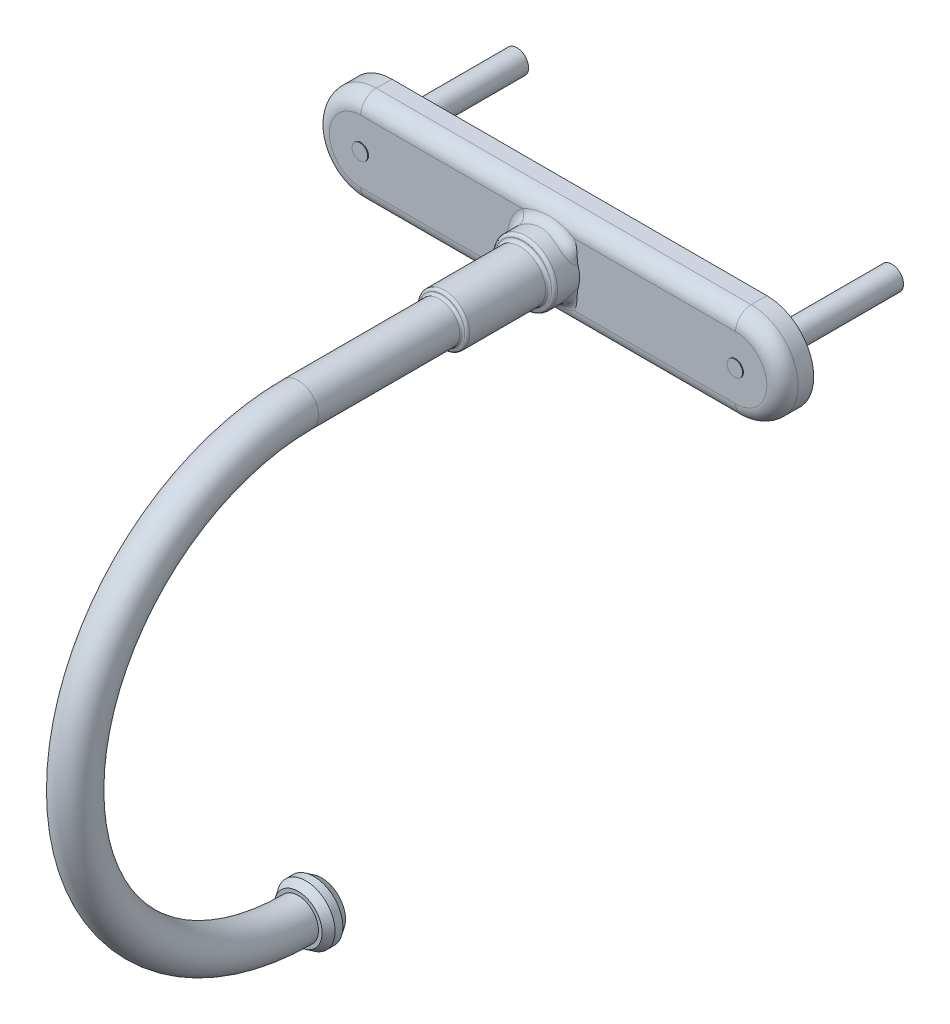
ISO-10303-21;
HEADER;
FILE_DESCRIPTION(('STEP AP214'),'2;1');
FILE_NAME('part.step','',(''),(''),'','','');
FILE_SCHEMA(('AUTOMOTIVE_DESIGN { 1 0 10303 214 1 1 1 1 }'));
ENDSEC;
DATA;
#1=APPLICATION_CONTEXT('core data for automotive mechanical design processes');
#2=APPLICATION_PROTOCOL_DEFINITION('international standard','automotive_design',2000,#1);
#3=PRODUCT_CONTEXT('',#1,'mechanical');
#4=PRODUCT('Part','Part','',(#3));
#5=PRODUCT_RELATED_PRODUCT_CATEGORY('part','',(#4));
#6=PRODUCT_DEFINITION_FORMATION('','',#4);
#7=PRODUCT_DEFINITION_CONTEXT('part definition',#1,'design');
#8=PRODUCT_DEFINITION('design','',#6,#7);
#9=PRODUCT_DEFINITION_SHAPE('','',#8);
#10=(LENGTH_UNIT() NAMED_UNIT(*) SI_UNIT(.MILLI.,.METRE.));
#11=(NAMED_UNIT(*) PLANE_ANGLE_UNIT() SI_UNIT($,.RADIAN.));
#12=(NAMED_UNIT(*) SI_UNIT($,.STERADIAN.) SOLID_ANGLE_UNIT());
#13=UNCERTAINTY_MEASURE_WITH_UNIT(LENGTH_MEASURE(1.E-05),#10,'distance_accuracy_value','');
#14=(GEOMETRIC_REPRESENTATION_CONTEXT(3) GLOBAL_UNCERTAINTY_ASSIGNED_CONTEXT((#13)) GLOBAL_UNIT_ASSIGNED_CONTEXT((#10,
#11,#12)) REPRESENTATION_CONTEXT('',''));
#15=CARTESIAN_POINT('',(0.,0.,0.));
#16=DIRECTION('',(0.,0.,1.));
#17=DIRECTION('',(1.,0.,0.));
#18=AXIS2_PLACEMENT_3D('',#15,#16,#17);
#19=CARTESIAN_POINT('',(-76.2,0.,12.7));
#20=DIRECTION('',(0.,0.,1.));
#21=DIRECTION('',(1.,0.,0.));
#22=AXIS2_PLACEMENT_3D('',#19,#20,#21);
#23=PLANE('',#22);
#24=CARTESIAN_POINT('',(0.,0.,12.7));
#25=DIRECTION('',(0.,0.,1.));
#26=DIRECTION('',(1.,0.,0.));
#27=AXIS2_PLACEMENT_3D('',#24,#25,#26);
#28=CIRCLE('',#27,12.7817879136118);
#29=CARTESIAN_POINT('',(12.2284913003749,-3.71996005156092,12.7));
#30=VERTEX_POINT('',#29);
#31=CARTESIAN_POINT('',(12.2284913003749,3.71996005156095,12.7));
#32=VERTEX_POINT('',#31);
#33=EDGE_CURVE('E237',#30,#32,#28,.T.);
#34=ORIENTED_EDGE('',*,*,#33,.F.);
#35=CARTESIAN_POINT('',(-10.3061106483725,-7.56030327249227,16.0449774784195));
#36=CARTESIAN_POINT('',(-9.68331093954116,-8.40929602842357,11.6923424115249));
#37=CARTESIAN_POINT('',(-13.3474393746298,-10.8752480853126,12.4321690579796));
#38=CARTESIAN_POINT('',(-10.1848340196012,-7.72568394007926,16.1092482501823));
#39=CARTESIAN_POINT('',(-9.60865346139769,-8.48258424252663,11.7734133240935));
#40=CARTESIAN_POINT('',(-13.1903740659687,-11.0096172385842,12.4724894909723));
#41=CARTESIAN_POINT('',(-10.0586355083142,-7.8893162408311,16.16508147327));
#42=CARTESIAN_POINT('',(-9.52958312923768,-8.56158840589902,11.8535972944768));
#43=CARTESIAN_POINT('',(-13.0269344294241,-11.1425658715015,12.5075166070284));
#44=CARTESIAN_POINT('',(-9.79711202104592,-8.21179239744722,16.2613483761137));
#45=CARTESIAN_POINT('',(-9.36151255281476,-8.72935426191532,12.0094442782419));
#46=CARTESIAN_POINT('',(-12.6882354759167,-11.404572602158,12.5679098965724));
#47=CARTESIAN_POINT('',(-9.66179178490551,-8.37063867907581,16.3017899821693));
#48=CARTESIAN_POINT('',(-9.27273907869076,-8.81789147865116,12.0850644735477));
#49=CARTESIAN_POINT('',(-12.5129822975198,-11.533632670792,12.5932810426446));
#50=CARTESIAN_POINT('',(-9.38339646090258,-8.68155221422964,16.3686249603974));
#51=CARTESIAN_POINT('',(-9.08428459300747,-9.00305442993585,12.2297106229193));
#52=CARTESIAN_POINT('',(-12.1524326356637,-11.786244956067,12.635210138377));
#53=CARTESIAN_POINT('',(-9.24036898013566,-8.83365241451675,16.3950956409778));
#54=CARTESIAN_POINT('',(-8.98489978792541,-9.09943627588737,12.2987776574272));
#55=CARTESIAN_POINT('',(-11.967197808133,-11.9098239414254,12.6518165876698));
#56=CARTESIAN_POINT('',(-8.94653691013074,-9.13111485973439,16.4359295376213));
#57=CARTESIAN_POINT('',(-8.7740301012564,-9.29869230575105,12.4294688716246));
#58=CARTESIAN_POINT('',(-11.5866560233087,-12.1515074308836,12.677433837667));
#59=CARTESIAN_POINT('',(-8.79573316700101,-9.27647783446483,16.4502940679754));
#60=CARTESIAN_POINT('',(-8.66276415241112,-9.40142411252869,12.4911523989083));
#61=CARTESIAN_POINT('',(-11.3913501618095,-12.2696125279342,12.6864454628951));
#62=CARTESIAN_POINT('',(-8.49674532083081,-9.55081002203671,16.4679579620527));
#63=CARTESIAN_POINT('',(-8.43516167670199,-9.60459199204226,12.6026891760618));
#64=CARTESIAN_POINT('',(-11.0041311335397,-12.4925030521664,12.6975269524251));
#65=CARTESIAN_POINT('',(-8.34899860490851,-9.68023463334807,16.4718996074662));
#66=CARTESIAN_POINT('',(-8.31984700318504,-9.70460973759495,12.6530779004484));
#67=CARTESIAN_POINT('',(-10.8127844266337,-12.5976584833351,12.6999997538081));
#68=CARTESIAN_POINT('',(-7.94432725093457,-10.0185473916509,16.4719006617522));
#69=CARTESIAN_POINT('',(-7.99683889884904,-9.97464033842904,12.7778035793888));
#70=CARTESIAN_POINT('',(-10.2886947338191,-12.8725322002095,12.7000004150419));
#71=CARTESIAN_POINT('',(-7.68202132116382,-10.2210557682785,16.4606999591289));
#72=CARTESIAN_POINT('',(-7.77824495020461,-10.147439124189,12.8460947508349));
#73=CARTESIAN_POINT('',(-9.94898243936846,-13.0370670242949,12.6929736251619));
#74=CARTESIAN_POINT('',(-7.14283913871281,-10.6048877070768,16.4219978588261));
#75=CARTESIAN_POINT('',(-7.31150376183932,-10.4898436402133,12.9618194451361));
#76=CARTESIAN_POINT('',(-9.25068783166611,-13.3489243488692,12.6686937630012));
#77=CARTESIAN_POINT('',(-6.86595138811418,-10.786194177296,16.3944834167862));
#78=CARTESIAN_POINT('',(-7.06373435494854,-10.6596387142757,13.0096879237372));
#79=CARTESIAN_POINT('',(-8.89209062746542,-13.4962329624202,12.6514325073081));
#80=CARTESIAN_POINT('',(-6.29855383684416,-11.12709431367,16.3287953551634));
#81=CARTESIAN_POINT('',(-6.54083693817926,-10.9891372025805,13.087280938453));
#82=CARTESIAN_POINT('',(-8.15725430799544,-13.7732088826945,12.6102229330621));
#83=CARTESIAN_POINT('',(-6.00800029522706,-11.2866108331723,16.2905852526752));
#84=CARTESIAN_POINT('',(-6.2657274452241,-11.1492302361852,13.1173287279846));
#85=CARTESIAN_POINT('',(-7.78095854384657,-13.9028135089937,12.5862517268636));
#86=CARTESIAN_POINT('',(-5.41581797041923,-11.5824246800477,16.2089761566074));
#87=CARTESIAN_POINT('',(-5.69238180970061,-11.4527700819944,13.1627476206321));
#88=CARTESIAN_POINT('',(-7.01402347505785,-14.1431575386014,12.5350540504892));
#89=CARTESIAN_POINT('',(-5.11419128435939,-11.7187263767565,16.1655781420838));
#90=CARTESIAN_POINT('',(-5.39399956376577,-11.5967631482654,13.1783982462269));
#91=CARTESIAN_POINT('',(-6.62338688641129,-14.2539004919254,12.5078281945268));
#92=CARTESIAN_POINT('',(-4.49340260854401,-11.9707358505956,16.077472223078));
#93=CARTESIAN_POINT('',(-4.76989044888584,-11.8669649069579,13.1994684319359));
#94=CARTESIAN_POINT('',(-5.81940374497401,-14.4586541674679,12.4525547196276));
#95=CARTESIAN_POINT('',(-4.17398913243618,-12.085823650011,16.0327593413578));
#96=CARTESIAN_POINT('',(-4.44311218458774,-11.9932900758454,13.2047959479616));
#97=CARTESIAN_POINT('',(-5.40573149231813,-14.5521611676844,12.4245039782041));
#98=CARTESIAN_POINT('',(-3.52665811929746,-12.2903212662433,15.9480155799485));
#99=CARTESIAN_POINT('',(-3.77309512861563,-12.2198983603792,13.2088543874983));
#100=CARTESIAN_POINT('',(-4.56737338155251,-14.7183122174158,12.3713397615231));
#101=CARTESIAN_POINT('',(-3.19874024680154,-12.3797300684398,15.9079848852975));
#102=CARTESIAN_POINT('',(-3.42917458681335,-12.3207721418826,13.2076657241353));
#103=CARTESIAN_POINT('',(-4.14268708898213,-14.7909554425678,12.3462264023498));
#104=CARTESIAN_POINT('',(-2.53689380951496,-12.5320926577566,15.836874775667));
#105=CARTESIAN_POINT('',(-2.72982264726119,-12.4935257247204,13.2026680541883));
#106=CARTESIAN_POINT('',(-3.28553005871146,-14.9147476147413,12.3016152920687));
#107=CARTESIAN_POINT('',(-2.20297804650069,-12.59509709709,15.8057782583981));
#108=CARTESIAN_POINT('',(-2.37354144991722,-12.5659492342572,13.1988795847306));
#109=CARTESIAN_POINT('',(-2.85307590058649,-14.9659377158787,12.2821068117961));
#110=CARTESIAN_POINT('',(-1.5306524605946,-12.6943554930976,15.7556706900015));
#111=CARTESIAN_POINT('',(-1.653358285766,-12.680183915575,13.1917731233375));
#112=CARTESIAN_POINT('',(-1.98234732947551,-15.0465835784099,12.2506717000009));
#113=CARTESIAN_POINT('',(-1.19224277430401,-12.7306102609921,15.7366592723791));
#114=CARTESIAN_POINT('',(-1.28842686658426,-12.7223385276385,13.1884418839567));
#115=CARTESIAN_POINT('',(-1.54407309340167,-15.0760399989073,12.2387448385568));
#116=CARTESIAN_POINT('',(-0.501861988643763,-12.7767719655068,15.7123228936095));
#117=CARTESIAN_POINT('',(-0.543349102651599,-12.7758950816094,13.184079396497));
#118=CARTESIAN_POINT('',(-0.649961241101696,-15.1135456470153,12.2234773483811));
#119=CARTESIAN_POINT('',(-0.149817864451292,-12.7857508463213,15.7074802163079));
#120=CARTESIAN_POINT('',(-0.161851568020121,-12.7863926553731,13.1831153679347));
#121=CARTESIAN_POINT('',(-0.194029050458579,-15.1208408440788,12.2204392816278));
#122=CARTESIAN_POINT('',(0.553740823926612,-12.7746336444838,15.713403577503));
#123=CARTESIAN_POINT('',(0.598868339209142,-12.7734685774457,13.184230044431));
#124=CARTESIAN_POINT('',(0.717149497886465,-15.1118082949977,12.2241553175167));
#125=CARTESIAN_POINT('',(0.905255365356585,-12.7545363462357,15.7241702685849));
#126=CARTESIAN_POINT('',(0.979356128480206,-12.7500024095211,13.1863126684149));
#127=CARTESIAN_POINT('',(1.1723958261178,-15.0954795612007,12.23090982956));
#128=CARTESIAN_POINT('',(1.60536066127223,-12.6854561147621,15.760114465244));
#129=CARTESIAN_POINT('',(1.7332401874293,-12.6700461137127,13.1923546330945));
#130=CARTESIAN_POINT('',(2.07910188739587,-15.0393529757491,12.253459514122));
#131=CARTESIAN_POINT('',(1.95394780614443,-12.6364416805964,15.7853076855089));
#132=CARTESIAN_POINT('',(2.1078377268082,-12.6132575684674,13.1963333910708));
#133=CARTESIAN_POINT('',(2.53055694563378,-14.9995295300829,12.2692645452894));
#134=CARTESIAN_POINT('',(2.64528185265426,-12.5099993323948,15.8472958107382));
#135=CARTESIAN_POINT('',(2.84462502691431,-12.4685420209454,13.2035047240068));
#136=CARTESIAN_POINT('',(3.42590336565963,-14.8967971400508,12.3081529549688));
#137=CARTESIAN_POINT('',(2.98802875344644,-12.4325714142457,15.8840907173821));
#138=CARTESIAN_POINT('',(3.20789132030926,-12.3801598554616,13.2067029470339));
#139=CARTESIAN_POINT('',(3.86979472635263,-14.833888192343,12.3312363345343));
#140=CARTESIAN_POINT('',(3.65245864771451,-12.2534674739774,15.9636252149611));
#141=CARTESIAN_POINT('',(3.90377785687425,-12.1790618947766,13.2084782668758));
#142=CARTESIAN_POINT('',(4.73029759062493,-14.6883690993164,12.3811325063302));
#143=CARTESIAN_POINT('',(3.97444504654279,-12.1528370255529,16.0060821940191));
#144=CARTESIAN_POINT('',(4.237966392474,-12.0668290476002,13.2071875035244));
#145=CARTESIAN_POINT('',(5.14730203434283,-14.6066084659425,12.4077680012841));
#146=CARTESIAN_POINT('',(4.60929354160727,-11.92652843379,16.0934843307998));
#147=CARTESIAN_POINT('',(4.88714742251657,-11.8194469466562,13.1963643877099));
#148=CARTESIAN_POINT('',(5.96949404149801,-14.4227363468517,12.4625999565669));
#149=CARTESIAN_POINT('',(4.92215533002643,-11.8008494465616,16.1384295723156));
#150=CARTESIAN_POINT('',(5.20270144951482,-11.6836923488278,13.1867118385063));
#151=CARTESIAN_POINT('',(6.37468120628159,-14.3206241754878,12.4907964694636));
#152=CARTESIAN_POINT('',(5.53710419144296,-11.5251081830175,16.225770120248));
#153=CARTESIAN_POINT('',(5.8111150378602,-11.3934708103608,13.1549471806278));
#154=CARTESIAN_POINT('',(7.17110120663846,-14.0965887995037,12.5455897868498));
#155=CARTESIAN_POINT('',(5.83919299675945,-11.375049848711,16.2681658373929));
#156=CARTESIAN_POINT('',(6.10428640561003,-11.2383997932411,13.1326084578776));
#157=CARTESIAN_POINT('',(7.56233628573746,-13.974668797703,12.5721868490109));
#158=CARTESIAN_POINT('',(6.43101516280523,-11.0512383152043,16.3449125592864));
#159=CARTESIAN_POINT('',(6.66472098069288,-10.9148282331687,13.0714422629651));
#160=CARTESIAN_POINT('',(8.32880491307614,-13.711577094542,12.6203341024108));
#161=CARTESIAN_POINT('',(6.72075069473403,-10.8774893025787,16.3792649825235));
#162=CARTESIAN_POINT('',(6.93201120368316,-10.745806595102,13.0322678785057));
#163=CARTESIAN_POINT('',(8.70404127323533,-13.5704087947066,12.6418851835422));
#164=CARTESIAN_POINT('',(7.23746627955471,-10.5390454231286,16.4292836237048));
#165=CARTESIAN_POINT('',(7.39357587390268,-10.4311539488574,12.9427758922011));
#166=CARTESIAN_POINT('',(9.37323940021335,-13.2954285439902,12.6732645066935));
#167=CARTESIAN_POINT('',(7.46666914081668,-10.377932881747,16.4471475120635));
#168=CARTESIAN_POINT('',(7.59296772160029,-10.2858533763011,12.8951280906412));
#169=CARTESIAN_POINT('',(9.67007992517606,-13.1645271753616,12.6844714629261));
#170=CARTESIAN_POINT('',(7.91422677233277,-10.0407950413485,16.4696995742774));
#171=CARTESIAN_POINT('',(7.97079496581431,-9.99507268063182,12.7851502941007));
#172=CARTESIAN_POINT('',(10.2497116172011,-12.8906080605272,12.698619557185));
#173=CARTESIAN_POINT('',(8.13258365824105,-9.86477266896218,16.4743903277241));
#174=CARTESIAN_POINT('',(8.14893323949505,-9.84953911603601,12.7225472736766));
#175=CARTESIAN_POINT('',(10.5325055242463,-12.747592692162,12.7015623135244));
#176=CARTESIAN_POINT('',(8.5568786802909,-9.4990662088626,16.4668502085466));
#177=CARTESIAN_POINT('',(8.48344623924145,-9.56351909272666,12.5826486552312));
#178=CARTESIAN_POINT('',(11.0820098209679,-12.450462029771,12.6968320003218));
#179=CARTESIAN_POINT('',(8.76283361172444,-9.3094013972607,16.4546427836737));
#180=CARTESIAN_POINT('',(8.63943176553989,-9.42314042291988,12.5051210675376));
#181=CARTESIAN_POINT('',(11.3487419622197,-12.2963623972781,12.6891736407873));
#182=CARTESIAN_POINT('',(9.16117143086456,-8.91767879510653,16.4094982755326));
#183=CARTESIAN_POINT('',(8.93035179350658,-9.15240659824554,12.3365678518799));
#184=CARTESIAN_POINT('',(11.8646290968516,-11.9780940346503,12.6608521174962));
#185=CARTESIAN_POINT('',(9.35355756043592,-8.71562398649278,16.3765661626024));
#186=CARTESIAN_POINT('',(9.06478585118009,-9.0223479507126,12.2453777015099));
#187=CARTESIAN_POINT('',(12.1137882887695,-11.8139277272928,12.6401920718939));
#188=CARTESIAN_POINT('',(9.68490587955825,-8.34417109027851,16.2955609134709));
#189=CARTESIAN_POINT('',(9.28822862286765,-8.80255119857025,12.0725523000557));
#190=CARTESIAN_POINT('',(12.5429173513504,-11.5121281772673,12.589373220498));
#191=CARTESIAN_POINT('',(9.82667760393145,-8.17668192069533,16.2520392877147));
#192=CARTESIAN_POINT('',(9.38088445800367,-8.70999390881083,11.9926007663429));
#193=CARTESIAN_POINT('',(12.7265258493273,-11.3760459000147,12.5620698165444));
#194=CARTESIAN_POINT('',(10.099957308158,-7.83661349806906,16.1478278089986));
#195=CARTESIAN_POINT('',(9.55574564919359,-8.53551043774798,11.8278605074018));
#196=CARTESIAN_POINT('',(13.0804502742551,-11.0997457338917,12.4966924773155));
#197=CARTESIAN_POINT('',(10.2314676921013,-7.66403545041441,16.0871419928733));
#198=CARTESIAN_POINT('',(9.63769675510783,-8.45384044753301,11.743131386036));
#199=CARTESIAN_POINT('',(13.2507693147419,-10.9595288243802,12.4586210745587));
#200=CARTESIAN_POINT('',(10.4835116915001,-7.31548517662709,15.9470527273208));
#201=CARTESIAN_POINT('',(9.79331951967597,-8.3015995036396,11.5709883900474));
#202=CARTESIAN_POINT('',(13.5771913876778,-10.6763372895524,12.3707357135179));
#203=CARTESIAN_POINT('',(10.6040486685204,-7.13951401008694,15.8676550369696));
#204=CARTESIAN_POINT('',(9.86675987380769,-8.23128699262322,11.483703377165));
#205=CARTESIAN_POINT('',(13.733298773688,-10.5333635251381,12.3209253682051));
#206=CARTESIAN_POINT('',(10.8336238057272,-6.78609577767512,15.6888814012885));
#207=CARTESIAN_POINT('',(10.0078942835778,-8.1008940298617,11.3083714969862));
#208=CARTESIAN_POINT('',(14.0306214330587,-10.2462168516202,12.2087712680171));
#209=CARTESIAN_POINT('',(10.9426618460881,-6.60864869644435,15.5895052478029));
#210=CARTESIAN_POINT('',(10.0753826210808,-8.04104881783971,11.2205076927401));
#211=CARTESIAN_POINT('',(14.1718365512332,-10.1020439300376,12.1464273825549));
#212=CARTESIAN_POINT('',(11.1494823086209,-6.25344978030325,15.3692898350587));
#213=CARTESIAN_POINT('',(10.207442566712,-7.92916356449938,11.0447711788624));
#214=CARTESIAN_POINT('',(14.4396896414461,-9.81345047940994,12.0082746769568));
#215=CARTESIAN_POINT('',(11.2471935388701,-6.0757024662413,15.2483258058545));
#216=CARTESIAN_POINT('',(10.2718083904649,-7.87736755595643,10.957121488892));
#217=CARTESIAN_POINT('',(14.566235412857,-9.66903362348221,11.9323875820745));
#218=CARTESIAN_POINT('',(11.430490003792,-5.72341098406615,14.9850086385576));
#219=CARTESIAN_POINT('',(10.3991488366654,-7.77897199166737,10.7825568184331));
#220=CARTESIAN_POINT('',(14.8036225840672,-9.38280241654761,11.7671948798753));
#221=CARTESIAN_POINT('',(11.5160750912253,-5.54886685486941,14.8426552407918));
#222=CARTESIAN_POINT('',(10.4619580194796,-7.73251922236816,10.6958632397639));
#223=CARTESIAN_POINT('',(14.914463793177,-9.24098809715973,11.6778891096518));
#224=CARTESIAN_POINT('',(11.675288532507,-5.20553049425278,14.5368233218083));
#225=CARTESIAN_POINT('',(10.5872390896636,-7.64155346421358,10.5222083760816));
#226=CARTESIAN_POINT('',(15.1206610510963,-8.96203278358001,11.4860246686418));
#227=CARTESIAN_POINT('',(11.7489202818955,-5.0367366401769,14.3733508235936));
#228=CARTESIAN_POINT('',(10.649559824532,-7.59715337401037,10.4354552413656));
#229=CARTESIAN_POINT('',(15.2160214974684,-8.82489047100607,11.3834697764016));
#230=CARTESIAN_POINT('',(11.8847543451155,-4.70727858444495,14.025995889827));
#231=CARTESIAN_POINT('',(10.7739297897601,-7.50755278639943,10.2595943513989));
#232=CARTESIAN_POINT('',(15.3919401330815,-8.55721105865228,11.1655557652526));
#233=CARTESIAN_POINT('',(11.946957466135,-4.54661380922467,13.8421148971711));
#234=CARTESIAN_POINT('',(10.8358454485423,-7.4624487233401,10.1706760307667));
#235=CARTESIAN_POINT('',(15.4724993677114,-8.42667349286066,11.0501975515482));
#236=CARTESIAN_POINT('',(12.0552704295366,-4.25052844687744,13.4736642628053));
#237=CARTESIAN_POINT('',(10.9526936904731,-7.37430154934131,9.99661176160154));
#238=CARTESIAN_POINT('',(15.6127754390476,-8.18610886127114,10.819049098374));
#239=CARTESIAN_POINT('',(12.1023502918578,-4.11416288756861,13.2908410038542));
#240=CARTESIAN_POINT('',(11.0076350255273,-7.33154886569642,9.91206686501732));
#241=CARTESIAN_POINT('',(15.6737485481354,-8.07531402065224,10.7043544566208));
#242=CARTESIAN_POINT('',(12.1885410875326,-3.85132548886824,12.9105446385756));
#243=CARTESIAN_POINT('',(11.1155755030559,-7.24393800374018,9.7370002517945));
#244=CARTESIAN_POINT('',(15.7853742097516,-7.86176282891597,10.4657745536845));
#245=CARTESIAN_POINT('',(12.2276486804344,-3.72485781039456,12.7130654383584));
#246=CARTESIAN_POINT('',(11.1685209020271,-7.1991334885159,9.64659059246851));
#247=CARTESIAN_POINT('',(15.8360224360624,-7.75900985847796,10.3418854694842));
#248=CARTESIAN_POINT('',(12.2986944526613,-3.48311705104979,12.304753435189));
#249=CARTESIAN_POINT('',(11.2712816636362,-7.10812180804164,9.45824084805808));
#250=CARTESIAN_POINT('',(15.928033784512,-7.56259934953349,10.0857298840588));
#251=CARTESIAN_POINT('',(12.3306292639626,-3.36784924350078,12.093914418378));
#252=CARTESIAN_POINT('',(11.3210710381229,-7.06195255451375,9.3603957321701));
#253=CARTESIAN_POINT('',(15.9693925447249,-7.46894609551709,9.95345948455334));
#254=CARTESIAN_POINT('',(12.3881583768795,-3.14966152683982,11.6603984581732));
#255=CARTESIAN_POINT('',(11.4163491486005,-6.96962291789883,9.1562245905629));
#256=CARTESIAN_POINT('',(16.0438984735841,-7.29167205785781,9.68149213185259));
#257=CARTESIAN_POINT('',(12.4137524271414,-3.04674210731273,11.4377210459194));
#258=CARTESIAN_POINT('',(11.4618402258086,-6.92347900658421,9.04997329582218));
#259=CARTESIAN_POINT('',(16.0770453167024,-7.20805167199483,9.54179488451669));
#260=CARTESIAN_POINT('',(12.4597443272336,-2.85288247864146,10.9790276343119));
#261=CARTESIAN_POINT('',(11.5481125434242,-6.83241371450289,8.82719268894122));
#262=CARTESIAN_POINT('',(16.1366094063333,-7.05054381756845,9.25403239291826));
#263=CARTESIAN_POINT('',(12.4800687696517,-2.76211922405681,10.7428739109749));
#264=CARTESIAN_POINT('',(11.5888511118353,-6.7875055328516,8.71058296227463));
#265=CARTESIAN_POINT('',(16.1629315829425,-6.97680012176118,9.10588074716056));
#266=CARTESIAN_POINT('',(12.5158936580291,-2.59495753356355,10.2615866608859));
#267=CARTESIAN_POINT('',(11.6641454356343,-6.70158800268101,8.46863104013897));
#268=CARTESIAN_POINT('',(16.2093283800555,-6.84098391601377,8.80394395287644));
#269=CARTESIAN_POINT('',(12.5313938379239,-2.51855989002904,10.0164526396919));
#270=CARTESIAN_POINT('',(11.6987406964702,-6.66054786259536,8.34329136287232));
#271=CARTESIAN_POINT('',(16.2294026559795,-6.77891204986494,8.65015849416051));
#272=CARTESIAN_POINT('',(12.5583004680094,-2.38079196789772,9.51904811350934));
#273=CARTESIAN_POINT('',(11.7611864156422,-6.58437676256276,8.08485591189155));
#274=CARTESIAN_POINT('',(16.2642494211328,-6.66697781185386,8.3381104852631));
#275=CARTESIAN_POINT('',(12.5697099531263,-2.31941055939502,9.26678304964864));
#276=CARTESIAN_POINT('',(11.7890874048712,-6.54919540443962,7.95172395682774));
#277=CARTESIAN_POINT('',(16.2790258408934,-6.61710639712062,8.17985134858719));
#278=CARTESIAN_POINT('',(12.5890342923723,-2.21203480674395,8.75662753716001));
#279=CARTESIAN_POINT('',(11.8378865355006,-6.48633663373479,7.67913657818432));
#280=CARTESIAN_POINT('',(16.3040527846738,-6.52986531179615,7.85980397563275));
#281=CARTESIAN_POINT('',(12.5969495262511,-2.16603879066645,8.49873770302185));
#282=CARTESIAN_POINT('',(11.8588283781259,-6.45860826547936,7.53959694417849));
#283=CARTESIAN_POINT('',(16.3143038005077,-6.49249428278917,7.69801612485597));
#284=CARTESIAN_POINT('',(12.6034102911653,-2.12794532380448,8.23885038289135));
#285=CARTESIAN_POINT('',(11.8761445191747,-6.43540041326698,7.39733909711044));
#286=CARTESIAN_POINT('',(16.3226711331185,-6.46154394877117,7.53497514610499));
#287=(BOUNDED_SURFACE() B_SPLINE_SURFACE(3,2,((#35,#36,#37),(#38,#39,#40),(#41,#42,#43),(#44,
#45,#46),(#47,#48,#49),(#50,#51,#52),(#53,#54,#55),(#56,#57,#58),(#59,#60,#61),(#62,#63,#64),
(#65,#66,#67),(#68,#69,#70),(#71,#72,#73),(#74,#75,#76),(#77,#78,#79),(#80,#81,#82),(#83,#84,
#85),(#86,#87,#88),(#89,#90,#91),(#92,#93,#94),(#95,#96,#97),(#98,#99,#100),(#101,#102,#103),
(#104,#105,#106),(#107,#108,#109),(#110,#111,#112),(#113,#114,#115),(#116,#117,#118),(#119,#120,
#121),(#122,#123,#124),(#125,#126,#127),(#128,#129,#130),(#131,#132,#133),(#134,#135,#136),
(#137,#138,#139),(#140,#141,#142),(#143,#144,#145),(#146,#147,#148),(#149,#150,#151),(#152,#153,
#154),(#155,#156,#157),(#158,#159,#160),(#161,#162,#163),(#164,#165,#166),(#167,#168,#169),
(#170,#171,#172),(#173,#174,#175),(#176,#177,#178),(#179,#180,#181),(#182,#183,#184),(#185,#186,
#187),(#188,#189,#190),(#191,#192,#193),(#194,#195,#196),(#197,#198,#199),(#200,#201,#202),
(#203,#204,#205),(#206,#207,#208),(#209,#210,#211),(#212,#213,#214),(#215,#216,#217),(#218,#219,
#220),(#221,#222,#223),(#224,#225,#226),(#227,#228,#229),(#230,#231,#232),(#233,#234,#235),
(#236,#237,#238),(#239,#240,#241),(#242,#243,#244),(#245,#246,#247),(#248,#249,#250),(#251,#252,
#253),(#254,#255,#256),(#257,#258,#259),(#260,#261,#262),(#263,#264,#265),(#266,#267,#268),
(#269,#270,#271),(#272,#273,#274),(#275,#276,#277),(#278,#279,#280),(#281,#282,#283),(#284,#285,
#286)),.UNSPECIFIED.,.F.,.F.,.F.) B_SPLINE_SURFACE_WITH_KNOTS((4,2,2,2,2,2,2,2,2,2,2,2,2,2,2,2,
2,2,2,2,2,2,2,2,2,2,2,2,2,2,2,2,2,2,2,2,2,2,2,2,2,4),(3,3),(0.,0.819454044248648,1.638485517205,
2.45293604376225,3.2672981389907,4.03016274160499,5.31623620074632,6.60333938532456,
7.89488753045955,9.18619231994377,10.5107158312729,11.8352916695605,13.1573147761,
14.4792977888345,15.8457838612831,17.2123270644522,18.5803616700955,19.948396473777,
21.2638863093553,22.5794204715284,23.894742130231,25.2098316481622,26.2987400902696,
27.3874352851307,28.4746213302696,29.5615467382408,30.4232440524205,31.2847388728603,
32.1459688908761,33.0072078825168,33.8735959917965,34.7399946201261,35.6061467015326,
36.4722375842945,37.2555303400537,38.0391506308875,38.8231381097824,39.6071566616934,
40.4015720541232,41.1960312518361,41.9898998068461,42.783682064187),(0.,1.),
.UNSPECIFIED.) GEOMETRIC_REPRESENTATION_ITEM() RATIONAL_B_SPLINE_SURFACE(((1.,0.644215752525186,
1.),(1.,0.647627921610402,1.),(1.,0.651299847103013,1.),(1.,0.659054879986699,1.),(1.,
0.663137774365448,1.),(1.,0.671586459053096,1.),(1.,0.67595053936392,1.),(1.,0.684876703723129,
1.),(1.,0.689438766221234,1.),(1.,0.698371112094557,1.),(1.,0.702735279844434,1.),(1.,
0.714476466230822,1.),(1.,0.721866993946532,1.),(1.,0.736384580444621,1.),(1.,0.743511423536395,
1.),(1.,0.75727574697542,1.),(1.,0.763911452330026,1.),(1.,0.776467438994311,1.),(1.,
0.782387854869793,1.),(1.,0.793498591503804,1.),(1.,0.798666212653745,1.),(1.,0.807948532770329,
1.),(1.,0.812063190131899,1.),(1.,0.819125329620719,1.),(1.,0.822075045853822,1.),(1.,
0.826740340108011,1.),(1.,0.828455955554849,1.),(1.,0.830642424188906,1.),(1.,0.831069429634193,
1.),(1.,0.830541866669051,1.),(1.,0.829587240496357,1.),(1.,0.82632284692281,1.),(1.,
0.824011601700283,1.),(1.,0.818099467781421,1.),(1.,0.814498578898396,1.),(1.,0.806269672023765,
1.),(1.,0.801686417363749,1.),(1.,0.791538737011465,1.),(1.,0.785974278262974,1.),(1.,
0.774013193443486,1.),(1.,0.767616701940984,1.),(1.,0.754175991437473,1.),(1.,0.747131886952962,
1.),(1.,0.733877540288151,1.),(1.,0.727732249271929,1.),(1.,0.715322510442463,1.),(1.,
0.709058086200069,1.),(1.,0.696612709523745,1.),(1.,0.690431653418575,1.),(1.,0.67837013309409,
1.),(1.,0.672489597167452,1.),(1.,0.662438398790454,1.),(1.,0.658165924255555,1.),(1.,
0.650090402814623,1.),(1.,0.646287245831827,1.),(1.,0.639267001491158,1.),(1.,0.636049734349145,
1.),(1.,0.63029556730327,1.),(1.,0.627758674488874,1.),(1.,0.623415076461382,1.),(1.,
0.621612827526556,1.),(1.,0.618779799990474,1.),(1.,0.617749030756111,1.),(1.,0.616428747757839,
1.),(1.,0.616139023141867,1.),(1.,0.616222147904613,1.),(1.,0.616594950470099,1.),(1.,
0.617823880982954,1.),(1.,0.618630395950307,1.),(1.,0.620584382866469,1.),(1.,0.621731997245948,
1.),(1.,0.624254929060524,1.),(1.,0.625630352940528,1.),(1.,0.628494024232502,1.),(1.,
0.629982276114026,1.),(1.,0.632982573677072,1.),(1.,0.634494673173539,1.),(1.,0.637421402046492,
1.),(1.,0.638836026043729,1.),(1.,0.641478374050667,1.),(1.,0.642706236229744,1.),(1.,
0.644909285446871,1.),(1.,0.645884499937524,1.),(1.,0.646700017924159,1.))) REPRESENTATION_ITEM('') SURFACE());
#288=CARTESIAN_POINT('',(12.2284913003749,-3.71996005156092,12.7));
#289=CARTESIAN_POINT('',(12.1962802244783,-3.82584006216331,12.7));
#290=CARTESIAN_POINT('',(12.1666054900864,-3.93246216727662,12.7));
#291=CARTESIAN_POINT('',(12.1119572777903,-4.1468566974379,12.7));
#292=CARTESIAN_POINT('',(12.0869816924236,-4.25462858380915,12.7));
#293=CARTESIAN_POINT('',(12.0186689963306,-4.578545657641,12.7));
#294=CARTESIAN_POINT('',(11.981723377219,-4.79604618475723,12.7));
#295=CARTESIAN_POINT('',(11.9212039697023,-5.2347963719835,12.7));
#296=CARTESIAN_POINT('',(11.8977543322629,-5.45606214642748,12.7));
#297=CARTESIAN_POINT('',(11.8606991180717,-5.89961910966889,12.7));
#298=CARTESIAN_POINT('',(11.8471050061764,-6.1219111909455,12.7));
#299=CARTESIAN_POINT('',(11.8253865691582,-6.56616433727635,12.7));
#300=CARTESIAN_POINT('',(11.8172486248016,-6.78812483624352,12.7));
#301=CARTESIAN_POINT('',(11.801760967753,-7.23209766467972,12.7));
#302=CARTESIAN_POINT('',(11.7944113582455,-7.45410999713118,12.7));
#303=CARTESIAN_POINT('',(11.7759713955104,-7.89791299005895,12.7));
#304=CARTESIAN_POINT('',(11.7648825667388,-8.11970370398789,12.7));
#305=CARTESIAN_POINT('',(11.7350222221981,-8.56277506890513,12.7));
#306=CARTESIAN_POINT('',(11.71625188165,-8.78405579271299,12.7));
#307=CARTESIAN_POINT('',(11.6683305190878,-9.22286584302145,12.7));
#308=CARTESIAN_POINT('',(11.6393056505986,-9.44040848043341,12.7));
#309=CARTESIAN_POINT('',(11.5689785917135,-9.87355274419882,12.7));
#310=CARTESIAN_POINT('',(11.5276751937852,-10.0891541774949,12.7));
#311=CARTESIAN_POINT('',(11.4318302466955,-10.5171912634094,12.7));
#312=CARTESIAN_POINT('',(11.3773014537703,-10.7296297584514,12.7));
#313=CARTESIAN_POINT('',(11.2546415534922,-11.1505355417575,12.7));
#314=CARTESIAN_POINT('',(11.1865121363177,-11.3590033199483,12.7));
#315=CARTESIAN_POINT('',(11.0623502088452,-11.7005790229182,12.7));
#316=CARTESIAN_POINT('',(11.0101421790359,-11.8350905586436,12.7));
#317=CARTESIAN_POINT('',(10.8998473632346,-12.1019568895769,12.7));
#318=CARTESIAN_POINT('',(10.841750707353,-12.2343076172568,12.7));
#319=CARTESIAN_POINT('',(10.7354418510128,-12.4629753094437,12.7));
#320=CARTESIAN_POINT('',(10.6884850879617,-12.5598775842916,12.7));
#321=CARTESIAN_POINT('',(10.6369148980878,-12.6620925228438,12.7));
#322=CARTESIAN_POINT('',(10.6338335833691,-12.6681844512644,12.7));
#323=CARTESIAN_POINT('',(10.6263944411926,-12.6828550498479,12.7));
#324=CARTESIAN_POINT('',(10.6220305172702,-12.6914306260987,12.7));
#325=CARTESIAN_POINT('',(10.6176543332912,-12.7,12.7));
#326=B_SPLINE_CURVE_WITH_KNOTS('',3,(#288,#289,#290,#291,#292,#293,#294,#295,#296,#297,#298,
#299,#300,#301,#302,#303,#304,#305,#306,#307,#308,#309,#310,#311,#312,#313,#314,#315,#316,#317,
#318,#319,#320,#321,#322,#323,#324,#325),.UNSPECIFIED.,.F.,.F.,(4,2,2,2,2,2,2,2,2,2,2,2,2,2,2,2,
2,2,4),(0.,0.331937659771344,0.6637260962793,1.32495214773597,1.99216747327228,2.6601577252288,
3.32647432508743,3.99287803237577,4.65901037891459,5.32504084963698,5.98314768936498,
6.64131927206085,7.29885853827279,7.95631614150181,8.38905794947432,8.82253745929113,
9.14551837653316,9.16599897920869,9.19486522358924),.UNSPECIFIED.);
#327=CARTESIAN_POINT('',(10.6176543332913,-12.7,12.7));
#328=VERTEX_POINT('',#327);
#329=EDGE_CURVE('E418',#30,#328,#326,.T.);
#330=ORIENTED_EDGE('',*,*,#329,.T.);
#331=DIRECTION('',(1.,0.,0.));
#332=VECTOR('',#331,1.);
#333=CARTESIAN_POINT('',(76.2,-12.7,12.7));
#334=LINE('',#333,#332);
#335=CARTESIAN_POINT('',(76.2,-12.7,12.7));
#336=VERTEX_POINT('',#335);
#337=EDGE_CURVE('E160',#328,#336,#334,.T.);
#338=ORIENTED_EDGE('',*,*,#337,.T.);
#339=CARTESIAN_POINT('',(76.2,0.,12.7));
#340=DIRECTION('',(0.,0.,1.));
#341=DIRECTION('',(1.,0.,0.));
#342=AXIS2_PLACEMENT_3D('',#339,#340,#341);
#343=CIRCLE('',#342,12.7);
#344=CARTESIAN_POINT('',(76.2,12.7,12.7));
#345=VERTEX_POINT('',#344);
#346=EDGE_CURVE('E163',#336,#345,#343,.T.);
#347=ORIENTED_EDGE('',*,*,#346,.T.);
#348=DIRECTION('',(-1.,0.,0.));
#349=VECTOR('',#348,1.);
#350=CARTESIAN_POINT('',(-76.2,12.7,12.7));
#351=LINE('',#350,#349);
#352=CARTESIAN_POINT('',(10.6176543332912,12.7,12.7));
#353=VERTEX_POINT('',#352);
#354=EDGE_CURVE('E168',#345,#353,#351,.T.);
#355=ORIENTED_EDGE('',*,*,#354,.T.);
#356=CARTESIAN_POINT('',(-13.3474393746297,10.8752480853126,12.4321690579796));
#357=CARTESIAN_POINT('',(-9.68331093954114,8.40929602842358,11.6923424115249));
#358=CARTESIAN_POINT('',(-10.3061106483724,7.56030327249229,16.0449774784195));
#359=CARTESIAN_POINT('',(-13.1903740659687,11.0096172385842,12.4724894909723));
#360=CARTESIAN_POINT('',(-9.60865346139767,8.48258424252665,11.7734133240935));
#361=CARTESIAN_POINT('',(-10.1848340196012,7.72568394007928,16.1092482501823));
#362=CARTESIAN_POINT('',(-13.026934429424,11.1425658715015,12.5075166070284));
#363=CARTESIAN_POINT('',(-9.52958312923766,8.56158840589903,11.8535972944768));
#364=CARTESIAN_POINT('',(-10.0586355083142,7.88931624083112,16.16508147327));
#365=CARTESIAN_POINT('',(-12.6882354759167,11.404572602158,12.5679098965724));
#366=CARTESIAN_POINT('',(-9.36151255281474,8.72935426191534,12.0094442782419));
#367=CARTESIAN_POINT('',(-9.7971120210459,8.21179239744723,16.2613483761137));
#368=CARTESIAN_POINT('',(-12.5129822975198,11.533632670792,12.5932810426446));
#369=CARTESIAN_POINT('',(-9.27273907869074,8.81789147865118,12.0850644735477));
#370=CARTESIAN_POINT('',(-9.66179178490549,8.37063867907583,16.3017899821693));
#371=CARTESIAN_POINT('',(-12.1524326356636,11.7862449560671,12.635210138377));
#372=CARTESIAN_POINT('',(-9.08428459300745,9.00305442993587,12.2297106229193));
#373=CARTESIAN_POINT('',(-9.38339646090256,8.68155221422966,16.3686249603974));
#374=CARTESIAN_POINT('',(-11.967197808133,11.9098239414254,12.6518165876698));
#375=CARTESIAN_POINT('',(-8.9848997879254,9.09943627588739,12.2987776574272));
#376=CARTESIAN_POINT('',(-9.24036898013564,8.83365241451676,16.3950956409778));
#377=CARTESIAN_POINT('',(-11.5866560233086,12.1515074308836,12.677433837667));
#378=CARTESIAN_POINT('',(-8.77403010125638,9.29869230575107,12.4294688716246));
#379=CARTESIAN_POINT('',(-8.94653691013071,9.1311148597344,16.4359295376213));
#380=CARTESIAN_POINT('',(-11.3913501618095,12.2696125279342,12.6864454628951));
#381=CARTESIAN_POINT('',(-8.6627641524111,9.4014241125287,12.4911523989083));
#382=CARTESIAN_POINT('',(-8.795733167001,9.27647783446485,16.4502940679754));
#383=CARTESIAN_POINT('',(-11.0041311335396,12.4925030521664,12.6975269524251));
#384=CARTESIAN_POINT('',(-8.43516167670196,9.60459199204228,12.6026891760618));
#385=CARTESIAN_POINT('',(-8.49674532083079,9.55081002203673,16.4679579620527));
#386=CARTESIAN_POINT('',(-10.8127844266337,12.5976584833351,12.6999997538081));
#387=CARTESIAN_POINT('',(-8.31984700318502,9.70460973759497,12.6530779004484));
#388=CARTESIAN_POINT('',(-8.34899860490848,9.68023463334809,16.4718996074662));
#389=CARTESIAN_POINT('',(-10.2886947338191,12.8725322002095,12.7000004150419));
#390=CARTESIAN_POINT('',(-7.99683889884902,9.97464033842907,12.7778035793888));
#391=CARTESIAN_POINT('',(-7.94432725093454,10.0185473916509,16.4719006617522));
#392=CARTESIAN_POINT('',(-9.94898243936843,13.0370670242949,12.6929736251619));
#393=CARTESIAN_POINT('',(-7.77824495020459,10.1474391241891,12.8460947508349));
#394=CARTESIAN_POINT('',(-7.6820213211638,10.2210557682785,16.4606999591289));
#395=CARTESIAN_POINT('',(-9.25068783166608,13.3489243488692,12.6686937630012));
#396=CARTESIAN_POINT('',(-7.31150376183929,10.4898436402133,12.9618194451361));
#397=CARTESIAN_POINT('',(-7.14283913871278,10.6048877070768,16.4219978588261));
#398=CARTESIAN_POINT('',(-8.89209062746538,13.4962329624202,12.6514325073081));
#399=CARTESIAN_POINT('',(-7.06373435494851,10.6596387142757,13.0096879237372));
#400=CARTESIAN_POINT('',(-6.86595138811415,10.786194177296,16.3944834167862));
#401=CARTESIAN_POINT('',(-8.15725430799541,13.7732088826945,12.6102229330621));
#402=CARTESIAN_POINT('',(-6.54083693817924,10.9891372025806,13.087280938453));
#403=CARTESIAN_POINT('',(-6.29855383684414,11.12709431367,16.3287953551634));
#404=CARTESIAN_POINT('',(-7.78095854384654,13.9028135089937,12.5862517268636));
#405=CARTESIAN_POINT('',(-6.26572744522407,11.1492302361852,13.1173287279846));
#406=CARTESIAN_POINT('',(-6.00800029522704,11.2866108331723,16.2905852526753));
#407=CARTESIAN_POINT('',(-7.01402347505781,14.1431575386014,12.5350540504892));
#408=CARTESIAN_POINT('',(-5.69238180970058,11.4527700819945,13.1627476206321));
#409=CARTESIAN_POINT('',(-5.41581797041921,11.5824246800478,16.2089761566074));
#410=CARTESIAN_POINT('',(-6.62338688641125,14.2539004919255,12.5078281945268));
#411=CARTESIAN_POINT('',(-5.39399956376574,11.5967631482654,13.1783982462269));
#412=CARTESIAN_POINT('',(-5.11419128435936,11.7187263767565,16.1655781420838));
#413=CARTESIAN_POINT('',(-5.81940374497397,14.4586541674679,12.4525547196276));
#414=CARTESIAN_POINT('',(-4.7698904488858,11.866964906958,13.1994684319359));
#415=CARTESIAN_POINT('',(-4.49340260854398,11.9707358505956,16.077472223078));
#416=CARTESIAN_POINT('',(-5.40573149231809,14.5521611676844,12.4245039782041));
#417=CARTESIAN_POINT('',(-4.44311218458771,11.9932900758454,13.2047959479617));
#418=CARTESIAN_POINT('',(-4.17398913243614,12.085823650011,16.0327593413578));
#419=CARTESIAN_POINT('',(-4.56737338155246,14.7183122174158,12.3713397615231));
#420=CARTESIAN_POINT('',(-3.77309512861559,12.2198983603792,13.2088543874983));
#421=CARTESIAN_POINT('',(-3.52665811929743,12.2903212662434,15.9480155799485));
#422=CARTESIAN_POINT('',(-4.14268708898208,14.7909554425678,12.3462264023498));
#423=CARTESIAN_POINT('',(-3.42917458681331,12.3207721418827,13.2076657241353));
#424=CARTESIAN_POINT('',(-3.19874024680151,12.3797300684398,15.9079848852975));
#425=CARTESIAN_POINT('',(-3.28553005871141,14.9147476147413,12.3016152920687));
#426=CARTESIAN_POINT('',(-2.72982264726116,12.4935257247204,13.2026680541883));
#427=CARTESIAN_POINT('',(-2.53689380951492,12.5320926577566,15.836874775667));
#428=CARTESIAN_POINT('',(-2.85307590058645,14.9659377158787,12.2821068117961));
#429=CARTESIAN_POINT('',(-2.37354144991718,12.5659492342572,13.1988795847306));
#430=CARTESIAN_POINT('',(-2.20297804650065,12.59509709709,15.8057782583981));
#431=CARTESIAN_POINT('',(-1.98234732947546,15.0465835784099,12.2506717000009));
#432=CARTESIAN_POINT('',(-1.65335828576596,12.680183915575,13.1917731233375));
#433=CARTESIAN_POINT('',(-1.53065246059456,12.6943554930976,15.7556706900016));
#434=CARTESIAN_POINT('',(-1.54407309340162,15.0760399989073,12.2387448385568));
#435=CARTESIAN_POINT('',(-1.28842686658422,12.7223385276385,13.1884418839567));
#436=CARTESIAN_POINT('',(-1.19224277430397,12.7306102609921,15.7366592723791));
#437=CARTESIAN_POINT('',(-0.649961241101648,15.1135456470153,12.2234773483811));
#438=CARTESIAN_POINT('',(-0.543349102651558,12.7758950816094,13.184079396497));
#439=CARTESIAN_POINT('',(-0.501861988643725,12.7767719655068,15.7123228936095));
#440=CARTESIAN_POINT('',(-0.194029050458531,15.1208408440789,12.2204392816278));
#441=CARTESIAN_POINT('',(-0.161851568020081,12.7863926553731,13.1831153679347));
#442=CARTESIAN_POINT('',(-0.149817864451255,12.7857508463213,15.707480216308));
#443=CARTESIAN_POINT('',(0.717149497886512,15.1118082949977,12.2241553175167));
#444=CARTESIAN_POINT('',(0.598868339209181,12.7734685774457,13.184230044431));
#445=CARTESIAN_POINT('',(0.553740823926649,12.7746336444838,15.713403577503));
#446=CARTESIAN_POINT('',(1.17239582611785,15.0954795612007,12.23090982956));
#447=CARTESIAN_POINT('',(0.979356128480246,12.7500024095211,13.1863126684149));
#448=CARTESIAN_POINT('',(0.905255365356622,12.7545363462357,15.7241702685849));
#449=CARTESIAN_POINT('',(2.07910188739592,15.0393529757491,12.253459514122));
#450=CARTESIAN_POINT('',(1.73324018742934,12.6700461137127,13.1923546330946));
#451=CARTESIAN_POINT('',(1.60536066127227,12.6854561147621,15.760114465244));
#452=CARTESIAN_POINT('',(2.53055694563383,14.9995295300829,12.2692645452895));
#453=CARTESIAN_POINT('',(2.10783772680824,12.6132575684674,13.1963333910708));
#454=CARTESIAN_POINT('',(1.95394780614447,12.6364416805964,15.785307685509));
#455=CARTESIAN_POINT('',(3.42590336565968,14.8967971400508,12.3081529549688));
#456=CARTESIAN_POINT('',(2.84462502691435,12.4685420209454,13.2035047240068));
#457=CARTESIAN_POINT('',(2.6452818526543,12.5099993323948,15.8472958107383));
#458=CARTESIAN_POINT('',(3.86979472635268,14.833888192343,12.3312363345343));
#459=CARTESIAN_POINT('',(3.20789132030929,12.3801598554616,13.2067029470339));
#460=CARTESIAN_POINT('',(2.98802875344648,12.4325714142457,15.8840907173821));
#461=CARTESIAN_POINT('',(4.73029759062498,14.6883690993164,12.3811325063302));
#462=CARTESIAN_POINT('',(3.90377785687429,12.1790618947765,13.2084782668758));
#463=CARTESIAN_POINT('',(3.65245864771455,12.2534674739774,15.9636252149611));
#464=CARTESIAN_POINT('',(5.14730203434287,14.6066084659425,12.4077680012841));
#465=CARTESIAN_POINT('',(4.23796639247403,12.0668290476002,13.2071875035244));
#466=CARTESIAN_POINT('',(3.97444504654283,12.1528370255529,16.0060821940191));
#467=CARTESIAN_POINT('',(5.96949404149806,14.4227363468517,12.4625999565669));
#468=CARTESIAN_POINT('',(4.8871474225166,11.8194469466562,13.1963643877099));
#469=CARTESIAN_POINT('',(4.60929354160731,11.92652843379,16.0934843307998));
#470=CARTESIAN_POINT('',(6.37468120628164,14.3206241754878,12.4907964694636));
#471=CARTESIAN_POINT('',(5.20270144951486,11.6836923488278,13.1867118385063));
#472=CARTESIAN_POINT('',(4.92215533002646,11.8008494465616,16.1384295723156));
#473=CARTESIAN_POINT('',(7.17110120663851,14.0965887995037,12.5455897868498));
#474=CARTESIAN_POINT('',(5.81111503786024,11.3934708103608,13.1549471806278));
#475=CARTESIAN_POINT('',(5.537104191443,11.5251081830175,16.225770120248));
#476=CARTESIAN_POINT('',(7.56233628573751,13.974668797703,12.5721868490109));
#477=CARTESIAN_POINT('',(6.10428640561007,11.238399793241,13.1326084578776));
#478=CARTESIAN_POINT('',(5.83919299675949,11.3750498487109,16.2681658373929));
#479=CARTESIAN_POINT('',(8.32880491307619,13.711577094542,12.6203341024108));
#480=CARTESIAN_POINT('',(6.66472098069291,10.9148282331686,13.0714422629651));
#481=CARTESIAN_POINT('',(6.43101516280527,11.0512383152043,16.3449125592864));
#482=CARTESIAN_POINT('',(8.70404127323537,13.5704087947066,12.6418851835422));
#483=CARTESIAN_POINT('',(6.93201120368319,10.745806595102,13.0322678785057));
#484=CARTESIAN_POINT('',(6.72075069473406,10.8774893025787,16.3792649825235));
#485=CARTESIAN_POINT('',(9.37323940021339,13.2954285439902,12.6732645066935));
#486=CARTESIAN_POINT('',(7.39357587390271,10.4311539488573,12.9427758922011));
#487=CARTESIAN_POINT('',(7.23746627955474,10.5390454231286,16.4292836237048));
#488=CARTESIAN_POINT('',(9.6700799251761,13.1645271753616,12.6844714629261));
#489=CARTESIAN_POINT('',(7.59296772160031,10.2858533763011,12.8951280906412));
#490=CARTESIAN_POINT('',(7.46666914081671,10.377932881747,16.4471475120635));
#491=CARTESIAN_POINT('',(10.2497116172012,12.8906080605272,12.698619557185));
#492=CARTESIAN_POINT('',(7.97079496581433,9.99507268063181,12.7851502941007));
#493=CARTESIAN_POINT('',(7.9142267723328,10.0407950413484,16.4696995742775));
#494=CARTESIAN_POINT('',(10.5325055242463,12.747592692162,12.7015623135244));
#495=CARTESIAN_POINT('',(8.14893323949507,9.849539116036,12.7225472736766));
#496=CARTESIAN_POINT('',(8.13258365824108,9.86477266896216,16.4743903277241));
#497=CARTESIAN_POINT('',(11.082009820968,12.450462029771,12.6968320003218));
#498=CARTESIAN_POINT('',(8.48344623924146,9.56351909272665,12.5826486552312));
#499=CARTESIAN_POINT('',(8.55687868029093,9.49906620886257,16.4668502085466));
#500=CARTESIAN_POINT('',(11.3487419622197,12.2963623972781,12.6891736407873));
#501=CARTESIAN_POINT('',(8.6394317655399,9.42314042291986,12.5051210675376));
#502=CARTESIAN_POINT('',(8.76283361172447,9.30940139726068,16.4546427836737));
#503=CARTESIAN_POINT('',(11.8646290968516,11.9780940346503,12.6608521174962));
#504=CARTESIAN_POINT('',(8.93035179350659,9.15240659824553,12.3365678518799));
#505=CARTESIAN_POINT('',(9.16117143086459,8.91767879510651,16.4094982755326));
#506=CARTESIAN_POINT('',(12.1137882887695,11.8139277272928,12.6401920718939));
#507=CARTESIAN_POINT('',(9.0647858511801,9.02234795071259,12.2453777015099));
#508=CARTESIAN_POINT('',(9.35355756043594,8.71562398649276,16.3765661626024));
#509=CARTESIAN_POINT('',(12.5429173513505,11.5121281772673,12.589373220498));
#510=CARTESIAN_POINT('',(9.28822862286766,8.80255119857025,12.0725523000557));
#511=CARTESIAN_POINT('',(9.68490587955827,8.34417109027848,16.2955609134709));
#512=CARTESIAN_POINT('',(12.7265258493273,11.3760459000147,12.5620698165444));
#513=CARTESIAN_POINT('',(9.38088445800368,8.70999390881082,11.9926007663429));
#514=CARTESIAN_POINT('',(9.82667760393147,8.17668192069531,16.2520392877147));
#515=CARTESIAN_POINT('',(13.0804502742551,11.0997457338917,12.4966924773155));
#516=CARTESIAN_POINT('',(9.55574564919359,8.53551043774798,11.8278605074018));
#517=CARTESIAN_POINT('',(10.0999573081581,7.83661349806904,16.1478278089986));
#518=CARTESIAN_POINT('',(13.2507693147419,10.9595288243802,12.4586210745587));
#519=CARTESIAN_POINT('',(9.63769675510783,8.45384044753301,11.743131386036));
#520=CARTESIAN_POINT('',(10.2314676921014,7.66403545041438,16.0871419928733));
#521=CARTESIAN_POINT('',(13.5771913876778,10.6763372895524,12.3707357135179));
#522=CARTESIAN_POINT('',(9.79331951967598,8.30159950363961,11.5709883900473));
#523=CARTESIAN_POINT('',(10.4835116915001,7.31548517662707,15.9470527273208));
#524=CARTESIAN_POINT('',(13.7332987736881,10.5333635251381,12.3209253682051));
#525=CARTESIAN_POINT('',(9.86675987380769,8.23128699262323,11.483703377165));
#526=CARTESIAN_POINT('',(10.6040486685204,7.13951401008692,15.8676550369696));
#527=CARTESIAN_POINT('',(14.0306214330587,10.2462168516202,12.2087712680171));
#528=CARTESIAN_POINT('',(10.0078942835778,8.10089402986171,11.3083714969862));
#529=CARTESIAN_POINT('',(10.8336238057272,6.78609577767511,15.6888814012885));
#530=CARTESIAN_POINT('',(14.1718365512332,10.1020439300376,12.1464273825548));
#531=CARTESIAN_POINT('',(10.0753826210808,8.04104881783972,11.2205076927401));
#532=CARTESIAN_POINT('',(10.9426618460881,6.60864869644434,15.5895052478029));
#533=CARTESIAN_POINT('',(14.4396896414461,9.81345047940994,12.0082746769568));
#534=CARTESIAN_POINT('',(10.207442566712,7.92916356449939,11.0447711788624));
#535=CARTESIAN_POINT('',(11.1494823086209,6.25344978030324,15.3692898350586));
#536=CARTESIAN_POINT('',(14.566235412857,9.66903362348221,11.9323875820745));
#537=CARTESIAN_POINT('',(10.2718083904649,7.87736755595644,10.9571214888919));
#538=CARTESIAN_POINT('',(11.2471935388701,6.07570246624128,15.2483258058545));
#539=CARTESIAN_POINT('',(14.8036225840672,9.38280241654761,11.7671948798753));
#540=CARTESIAN_POINT('',(10.3991488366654,7.77897199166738,10.782556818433));
#541=CARTESIAN_POINT('',(11.430490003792,5.72341098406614,14.9850086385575));
#542=CARTESIAN_POINT('',(14.914463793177,9.24098809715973,11.6778891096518));
#543=CARTESIAN_POINT('',(10.4619580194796,7.73251922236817,10.6958632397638));
#544=CARTESIAN_POINT('',(11.5160750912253,5.5488668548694,14.8426552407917));
#545=CARTESIAN_POINT('',(15.1206610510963,8.96203278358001,11.4860246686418));
#546=CARTESIAN_POINT('',(10.5872390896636,7.6415534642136,10.5222083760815));
#547=CARTESIAN_POINT('',(11.675288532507,5.20553049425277,14.5368233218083));
#548=CARTESIAN_POINT('',(15.2160214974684,8.82489047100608,11.3834697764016));
#549=CARTESIAN_POINT('',(10.649559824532,7.59715337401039,10.4354552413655));
#550=CARTESIAN_POINT('',(11.7489202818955,5.03673664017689,14.3733508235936));
#551=CARTESIAN_POINT('',(15.3919401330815,8.55721105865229,11.1655557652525));
#552=CARTESIAN_POINT('',(10.7739297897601,7.50755278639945,10.2595943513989));
#553=CARTESIAN_POINT('',(11.8847543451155,4.70727858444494,14.025995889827));
#554=CARTESIAN_POINT('',(15.4724993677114,8.42667349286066,11.0501975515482));
#555=CARTESIAN_POINT('',(10.8358454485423,7.46244872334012,10.1706760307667));
#556=CARTESIAN_POINT('',(11.946957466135,4.54661380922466,13.842114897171));
#557=CARTESIAN_POINT('',(15.6127754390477,8.18610886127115,10.819049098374));
#558=CARTESIAN_POINT('',(10.9526936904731,7.37430154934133,9.99661176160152));
#559=CARTESIAN_POINT('',(12.0552704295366,4.25052844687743,13.4736642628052));
#560=CARTESIAN_POINT('',(15.6737485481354,8.07531402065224,10.7043544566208));
#561=CARTESIAN_POINT('',(11.0076350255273,7.33154886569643,9.9120668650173));
#562=CARTESIAN_POINT('',(12.1023502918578,4.11416288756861,13.2908410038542));
#563=CARTESIAN_POINT('',(15.7853742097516,7.86176282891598,10.4657745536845));
#564=CARTESIAN_POINT('',(11.1155755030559,7.2439380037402,9.73700025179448));
#565=CARTESIAN_POINT('',(12.1885410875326,3.85132548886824,12.9105446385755));
#566=CARTESIAN_POINT('',(15.8360224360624,7.75900985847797,10.3418854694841));
#567=CARTESIAN_POINT('',(11.1685209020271,7.19913348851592,9.64659059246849));
#568=CARTESIAN_POINT('',(12.2276486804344,3.72485781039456,12.7130654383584));
#569=CARTESIAN_POINT('',(15.928033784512,7.5625993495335,10.0857298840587));
#570=CARTESIAN_POINT('',(11.2712816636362,7.10812180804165,9.45824084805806));
#571=CARTESIAN_POINT('',(12.2986944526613,3.48311705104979,12.304753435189));
#572=CARTESIAN_POINT('',(15.9693925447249,7.4689460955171,9.95345948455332));
#573=CARTESIAN_POINT('',(11.3210710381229,7.06195255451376,9.36039573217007));
#574=CARTESIAN_POINT('',(12.3306292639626,3.36784924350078,12.0939144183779));
#575=CARTESIAN_POINT('',(16.0438984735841,7.29167205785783,9.68149213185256));
#576=CARTESIAN_POINT('',(11.4163491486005,6.96962291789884,9.15622459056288));
#577=CARTESIAN_POINT('',(12.3881583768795,3.14966152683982,11.6603984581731));
#578=CARTESIAN_POINT('',(16.0770453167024,7.20805167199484,9.54179488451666));
#579=CARTESIAN_POINT('',(11.4618402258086,6.92347900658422,9.04997329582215));
#580=CARTESIAN_POINT('',(12.4137524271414,3.04674210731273,11.4377210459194));
#581=CARTESIAN_POINT('',(16.1366094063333,7.05054381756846,9.25403239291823));
#582=CARTESIAN_POINT('',(11.5481125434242,6.8324137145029,8.82719268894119));
#583=CARTESIAN_POINT('',(12.4597443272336,2.85288247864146,10.9790276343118));
#584=CARTESIAN_POINT('',(16.1629315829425,6.9768001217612,9.10588074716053));
#585=CARTESIAN_POINT('',(11.5888511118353,6.78750553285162,8.71058296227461));
#586=CARTESIAN_POINT('',(12.4800687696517,2.76211922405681,10.7428739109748));
#587=CARTESIAN_POINT('',(16.2093283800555,6.84098391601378,8.80394395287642));
#588=CARTESIAN_POINT('',(11.6641454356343,6.70158800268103,8.46863104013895));
#589=CARTESIAN_POINT('',(12.5158936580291,2.59495753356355,10.2615866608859));
#590=CARTESIAN_POINT('',(16.2294026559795,6.77891204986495,8.65015849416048));
#591=CARTESIAN_POINT('',(11.6987406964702,6.66054786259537,8.34329136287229));
#592=CARTESIAN_POINT('',(12.5313938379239,2.51855989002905,10.0164526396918));
#593=CARTESIAN_POINT('',(16.2642494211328,6.66697781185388,8.33811048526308));
#594=CARTESIAN_POINT('',(11.7611864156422,6.58437676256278,8.08485591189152));
#595=CARTESIAN_POINT('',(12.5583004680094,2.38079196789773,9.5190481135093));
#596=CARTESIAN_POINT('',(16.2790258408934,6.61710639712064,8.17985134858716));
#597=CARTESIAN_POINT('',(11.7890874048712,6.54919540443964,7.95172395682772));
#598=CARTESIAN_POINT('',(12.5697099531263,2.31941055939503,9.26678304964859));
#599=CARTESIAN_POINT('',(16.3040527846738,6.52986531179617,7.85980397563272));
#600=CARTESIAN_POINT('',(11.8378865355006,6.48633663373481,7.67913657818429));
#601=CARTESIAN_POINT('',(12.5890342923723,2.21203480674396,8.75662753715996));
#602=CARTESIAN_POINT('',(16.3143038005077,6.49249428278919,7.69801612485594));
#603=CARTESIAN_POINT('',(11.8588283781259,6.45860826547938,7.53959694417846));
#604=CARTESIAN_POINT('',(12.5969495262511,2.16603879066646,8.49873770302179));
#605=CARTESIAN_POINT('',(16.3226711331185,6.46154394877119,7.53497514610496));
#606=CARTESIAN_POINT('',(11.8761445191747,6.435400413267,7.39733909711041));
#607=CARTESIAN_POINT('',(12.6034102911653,2.1279453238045,8.2388503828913));
#608=(BOUNDED_SURFACE() B_SPLINE_SURFACE(3,2,((#356,#357,#358),(#359,#360,#361),(#362,#363,
#364),(#365,#366,#367),(#368,#369,#370),(#371,#372,#373),(#374,#375,#376),(#377,#378,#379),
(#380,#381,#382),(#383,#384,#385),(#386,#387,#388),(#389,#390,#391),(#392,#393,#394),(#395,#396,
#397),(#398,#399,#400),(#401,#402,#403),(#404,#405,#406),(#407,#408,#409),(#410,#411,#412),
(#413,#414,#415),(#416,#417,#418),(#419,#420,#421),(#422,#423,#424),(#425,#426,#427),(#428,#429,
#430),(#431,#432,#433),(#434,#435,#436),(#437,#438,#439),(#440,#441,#442),(#443,#444,#445),
(#446,#447,#448),(#449,#450,#451),(#452,#453,#454),(#455,#456,#457),(#458,#459,#460),(#461,#462,
#463),(#464,#465,#466),(#467,#468,#469),(#470,#471,#472),(#473,#474,#475),(#476,#477,#478),
(#479,#480,#481),(#482,#483,#484),(#485,#486,#487),(#488,#489,#490),(#491,#492,#493),(#494,#495,
#496),(#497,#498,#499),(#500,#501,#502),(#503,#504,#505),(#506,#507,#508),(#509,#510,#511),
(#512,#513,#514),(#515,#516,#517),(#518,#519,#520),(#521,#522,#523),(#524,#525,#526),(#527,#528,
#529),(#530,#531,#532),(#533,#534,#535),(#536,#537,#538),(#539,#540,#541),(#542,#543,#544),
(#545,#546,#547),(#548,#549,#550),(#551,#552,#553),(#554,#555,#556),(#557,#558,#559),(#560,#561,
#562),(#563,#564,#565),(#566,#567,#568),(#569,#570,#571),(#572,#573,#574),(#575,#576,#577),
(#578,#579,#580),(#581,#582,#583),(#584,#585,#586),(#587,#588,#589),(#590,#591,#592),(#593,#594,
#595),(#596,#597,#598),(#599,#600,#601),(#602,#603,#604),(#605,#606,#607)),.UNSPECIFIED.,.F.,
.F.,.F.) B_SPLINE_SURFACE_WITH_KNOTS((4,2,2,2,2,2,2,2,2,2,2,2,2,2,2,2,2,2,2,2,2,2,2,2,2,2,2,2,2,
2,2,2,2,2,2,2,2,2,2,2,2,4),(3,3),(0.,0.819454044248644,1.638485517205,2.45293604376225,
3.2672981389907,4.030162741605,5.31623620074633,6.60333938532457,7.89488753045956,
9.18619231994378,10.5107158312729,11.8352916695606,13.1573147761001,14.4792977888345,
15.8457838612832,17.2123270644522,18.5803616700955,19.948396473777,21.2638863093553,
22.5794204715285,23.8947421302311,25.2098316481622,26.2987400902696,27.3874352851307,
28.4746213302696,29.5615467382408,30.4232440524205,31.2847388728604,32.1459688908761,
33.0072078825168,33.8735959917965,34.7399946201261,35.6061467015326,36.4722375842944,
37.2555303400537,38.0391506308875,38.8231381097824,39.6071566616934,40.4015720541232,
41.1960312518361,41.9898998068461,42.783682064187),(0.,1.),
.UNSPECIFIED.) GEOMETRIC_REPRESENTATION_ITEM() RATIONAL_B_SPLINE_SURFACE(((1.,0.644215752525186,
1.),(1.,0.647627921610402,1.),(1.,0.651299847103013,1.),(1.,0.659054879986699,1.),(1.,
0.663137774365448,1.),(1.,0.671586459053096,1.),(1.,0.67595053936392,1.),(1.,0.684876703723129,
1.),(1.,0.689438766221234,1.),(1.,0.698371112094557,1.),(1.,0.702735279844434,1.),(1.,
0.714476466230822,1.),(1.,0.721866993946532,1.),(1.,0.736384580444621,1.),(1.,0.743511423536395,
1.),(1.,0.75727574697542,1.),(1.,0.763911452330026,1.),(1.,0.77646743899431,1.),(1.,
0.782387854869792,1.),(1.,0.793498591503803,1.),(1.,0.798666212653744,1.),(1.,0.807948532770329,
1.),(1.,0.812063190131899,1.),(1.,0.819125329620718,1.),(1.,0.822075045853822,1.),(1.,
0.82674034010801,1.),(1.,0.828455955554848,1.),(1.,0.830642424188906,1.),(1.,0.831069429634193,
1.),(1.,0.83054186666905,1.),(1.,0.829587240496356,1.),(1.,0.826322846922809,1.),(1.,
0.824011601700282,1.),(1.,0.81809946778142,1.),(1.,0.814498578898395,1.),(1.,0.806269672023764,
1.),(1.,0.801686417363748,1.),(1.,0.791538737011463,1.),(1.,0.785974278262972,1.),(1.,
0.774013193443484,1.),(1.,0.767616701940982,1.),(1.,0.754175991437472,1.),(1.,0.747131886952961,
1.),(1.,0.73387754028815,1.),(1.,0.727732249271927,1.),(1.,0.715322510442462,1.),(1.,
0.709058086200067,1.),(1.,0.696612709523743,1.),(1.,0.690431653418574,1.),(1.,0.678370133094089,
1.),(1.,0.672489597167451,1.),(1.,0.662438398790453,1.),(1.,0.658165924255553,1.),(1.,
0.650090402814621,1.),(1.,0.646287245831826,1.),(1.,0.639267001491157,1.),(1.,0.636049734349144,
1.),(1.,0.630295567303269,1.),(1.,0.627758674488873,1.),(1.,0.623415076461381,1.),(1.,
0.621612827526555,1.),(1.,0.618779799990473,1.),(1.,0.61774903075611,1.),(1.,0.616428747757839,
1.),(1.,0.616139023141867,1.),(1.,0.616222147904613,1.),(1.,0.616594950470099,1.),(1.,
0.617823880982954,1.),(1.,0.618630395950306,1.),(1.,0.620584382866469,1.),(1.,0.621731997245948,
1.),(1.,0.624254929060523,1.),(1.,0.625630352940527,1.),(1.,0.628494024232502,1.),(1.,
0.629982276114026,1.),(1.,0.632982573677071,1.),(1.,0.634494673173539,1.),(1.,0.637421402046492,
1.),(1.,0.638836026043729,1.),(1.,0.641478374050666,1.),(1.,0.642706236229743,1.),(1.,
0.644909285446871,1.),(1.,0.645884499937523,1.),(1.,0.646700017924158,1.))) REPRESENTATION_ITEM('') SURFACE());
#609=CARTESIAN_POINT('',(12.2284913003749,3.71996005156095,12.7));
#610=CARTESIAN_POINT('',(12.1962802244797,3.82584006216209,12.7));
#611=CARTESIAN_POINT('',(12.1666054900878,3.93246216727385,12.7));
#612=CARTESIAN_POINT('',(12.111957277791,4.14685669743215,12.7));
#613=CARTESIAN_POINT('',(12.0869816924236,4.25462858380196,12.7));
#614=CARTESIAN_POINT('',(12.0186689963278,4.57854565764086,12.7));
#615=CARTESIAN_POINT('',(11.9817233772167,4.79604618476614,12.7));
#616=CARTESIAN_POINT('',(11.9212039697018,5.23479637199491,12.7));
#617=CARTESIAN_POINT('',(11.8977543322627,5.45606214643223,12.7));
#618=CARTESIAN_POINT('',(11.8606991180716,5.89961910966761,12.7));
#619=CARTESIAN_POINT('',(11.8471050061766,6.12191119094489,12.7));
#620=CARTESIAN_POINT('',(11.8253865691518,6.56616433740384,12.7));
#621=CARTESIAN_POINT('',(11.8172486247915,6.78812483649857,12.7));
#622=CARTESIAN_POINT('',(11.8017609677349,7.23209766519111,12.7));
#623=CARTESIAN_POINT('',(11.7944113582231,7.45410999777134,12.7));
#624=CARTESIAN_POINT('',(11.7759713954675,7.89791299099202,12.7));
#625=CARTESIAN_POINT('',(11.7648825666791,8.11970370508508,12.7));
#626=CARTESIAN_POINT('',(11.7350222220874,8.56277507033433,12.7));
#627=CARTESIAN_POINT('',(11.716251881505,8.78405579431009,12.7));
#628=CARTESIAN_POINT('',(11.6683305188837,9.22286584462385,12.7));
#629=CARTESIAN_POINT('',(11.6393056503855,9.4404084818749,12.7));
#630=CARTESIAN_POINT('',(11.5689785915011,9.87355274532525,12.7));
#631=CARTESIAN_POINT('',(11.5276751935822,10.0891541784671,12.7));
#632=CARTESIAN_POINT('',(11.4318302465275,10.5171912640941,12.7));
#633=CARTESIAN_POINT('',(11.3773014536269,10.7296297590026,12.7));
#634=CARTESIAN_POINT('',(11.2546415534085,11.1505355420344,12.7));
#635=CARTESIAN_POINT('',(11.1865121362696,11.3590033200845,12.7));
#636=CARTESIAN_POINT('',(11.0623502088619,11.7005790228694,12.7));
#637=CARTESIAN_POINT('',(11.010142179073,11.8350905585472,12.7));
#638=CARTESIAN_POINT('',(10.8998473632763,12.1019568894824,12.7));
#639=CARTESIAN_POINT('',(10.8417507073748,12.23430761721,12.7));
#640=CARTESIAN_POINT('',(10.7354418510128,12.4629753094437,12.7));
#641=CARTESIAN_POINT('',(10.6884850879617,12.5598775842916,12.7));
#642=CARTESIAN_POINT('',(10.6369148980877,12.6620925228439,12.7));
#643=CARTESIAN_POINT('',(10.633833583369,12.6681844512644,12.7));
#644=CARTESIAN_POINT('',(10.6263944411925,12.682855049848,12.7));
#645=CARTESIAN_POINT('',(10.6220305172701,12.6914306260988,12.7));
#646=CARTESIAN_POINT('',(10.6176543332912,12.7000000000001,12.7));
#647=B_SPLINE_CURVE_WITH_KNOTS('',3,(#609,#610,#611,#612,#613,#614,#615,#616,#617,#618,#619,
#620,#621,#622,#623,#624,#625,#626,#627,#628,#629,#630,#631,#632,#633,#634,#635,#636,#637,#638,
#639,#640,#641,#642,#643,#644,#645,#646),.UNSPECIFIED.,.F.,.F.,(4,2,2,2,2,2,2,2,2,2,2,2,2,2,2,2,
2,2,4),(0.,0.331937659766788,0.663726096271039,1.32495214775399,1.99216747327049,
2.66015772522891,3.32647432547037,3.99287803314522,4.65901038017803,5.32504085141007,
5.98314769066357,6.64131927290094,7.29885853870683,7.95631614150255,8.38905794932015,
8.82253745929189,9.14551837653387,9.16599897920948,9.19486522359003),.UNSPECIFIED.);
#648=EDGE_CURVE('E913',#353,#32,#647,.F.);
#649=ORIENTED_EDGE('',*,*,#648,.T.);
#650=EDGE_LOOP('',(#34,#330,#338,#347,#355,#649));
#651=FACE_BOUND('',#650,.T.);
#652=CARTESIAN_POINT('',(76.2,0.,12.7));
#653=DIRECTION('',(0.,0.,1.));
#654=DIRECTION('',(1.,0.,0.));
#655=AXIS2_PLACEMENT_3D('',#652,#653,#654);
#656=CIRCLE('',#655,3.175);
#657=CARTESIAN_POINT('',(79.375,0.,12.7));
#658=VERTEX_POINT('',#657);
#659=EDGE_CURVE('E473',#658,#658,#656,.T.);
#660=ORIENTED_EDGE('',*,*,#659,.F.);
#661=EDGE_LOOP('',(#660));
#662=FACE_BOUND('',#661,.T.);
#663=ADVANCED_FACE('F34',(#651,#662),#23,.T.);
#664=CARTESIAN_POINT('',(-76.2,-12.7,12.7));
#665=VERTEX_POINT('',#664);
#666=CARTESIAN_POINT('',(-10.6176543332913,-12.7,12.7));
#667=VERTEX_POINT('',#666);
#668=EDGE_CURVE('E161',#665,#667,#334,.T.);
#669=ORIENTED_EDGE('',*,*,#668,.T.);
#670=CARTESIAN_POINT('',(0.,0.,12.7));
#671=DIRECTION('',(0.,0.,1.));
#672=DIRECTION('',(1.,0.,0.));
#673=AXIS2_PLACEMENT_3D('',#670,#671,#672);
#674=CIRCLE('',#673,16.5536879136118);
#675=CARTESIAN_POINT('',(-10.6176543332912,12.7,12.7));
#676=VERTEX_POINT('',#675);
#677=EDGE_CURVE('E50',#667,#676,#674,.F.);
#678=ORIENTED_EDGE('',*,*,#677,.T.);
#679=CARTESIAN_POINT('',(-76.2,12.7,12.7));
#680=VERTEX_POINT('',#679);
#681=EDGE_CURVE('E167',#676,#680,#351,.T.);
#682=ORIENTED_EDGE('',*,*,#681,.T.);
#683=CARTESIAN_POINT('',(-76.2,0.,12.7));
#684=DIRECTION('',(0.,0.,1.));
#685=DIRECTION('',(1.,0.,0.));
#686=AXIS2_PLACEMENT_3D('',#683,#684,#685);
#687=CIRCLE('',#686,12.7);
#688=EDGE_CURVE('E165',#680,#665,#687,.T.);
#689=ORIENTED_EDGE('',*,*,#688,.T.);
#690=EDGE_LOOP('',(#669,#678,#682,#689));
#691=FACE_BOUND('',#690,.T.);
#692=CARTESIAN_POINT('',(-76.2,0.,12.7));
#693=DIRECTION('',(0.,0.,1.));
#694=DIRECTION('',(1.,0.,0.));
#695=AXIS2_PLACEMENT_3D('',#692,#693,#694);
#696=CIRCLE('',#695,3.175);
#697=CARTESIAN_POINT('',(-73.025,0.,12.7));
#698=VERTEX_POINT('',#697);
#699=EDGE_CURVE('E467',#698,#698,#696,.T.);
#700=ORIENTED_EDGE('',*,*,#699,.F.);
#701=EDGE_LOOP('',(#700));
#702=FACE_BOUND('',#701,.T.);
#703=ADVANCED_FACE('F273',(#691,#702),#23,.T.);
#704=CARTESIAN_POINT('',(0.,0.,12.7));
#705=DIRECTION('',(0.,0.,1.));
#706=DIRECTION('',(1.,0.,0.));
#707=AXIS2_PLACEMENT_3D('',#704,#705,#706);
#708=CIRCLE('',#707,4.7625);
#709=CARTESIAN_POINT('',(4.7625,0.,12.7));
#710=VERTEX_POINT('',#709);
#711=EDGE_CURVE('E295',#710,#710,#708,.T.);
#712=ORIENTED_EDGE('',*,*,#711,.T.);
#713=EDGE_LOOP('',(#712));
#714=FACE_BOUND('',#713,.T.);
#715=ADVANCED_FACE('F276',(#714),#23,.T.);
#716=CARTESIAN_POINT('',(0.,0.,114.3));
#717=DIRECTION('',(0.,0.,-1.));
#718=DIRECTION('',(0.,1.,0.));
#719=AXIS2_PLACEMENT_3D('',#716,#717,#718);
#720=CYLINDRICAL_SURFACE('',#719,4.7625);
#721=CARTESIAN_POINT('',(0.,0.,114.3));
#722=DIRECTION('',(0.,0.,1.));
#723=DIRECTION('',(1.,0.,0.));
#724=AXIS2_PLACEMENT_3D('',#721,#722,#723);
#725=CIRCLE('',#724,4.7625);
#726=CARTESIAN_POINT('',(0.,4.76249999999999,114.3));
#727=VERTEX_POINT('',#726);
#728=EDGE_CURVE('E297',#727,#727,#725,.T.);
#729=ORIENTED_EDGE('',*,*,#728,.T.);
#730=EDGE_LOOP('',(#729));
#731=FACE_BOUND('',#730,.T.);
#732=ORIENTED_EDGE('',*,*,#711,.F.);
#733=EDGE_LOOP('',(#732));
#734=FACE_BOUND('',#733,.T.);
#735=ADVANCED_FACE('F286',(#731,#734),#720,.F.);
#736=CARTESIAN_POINT('',(0.,-90.6598672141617,114.3));
#737=DIRECTION('',(1.,0.,0.));
#738=DIRECTION('',(0.,0.,-1.));
#739=AXIS2_PLACEMENT_3D('',#736,#737,#738);
#740=TOROIDAL_SURFACE('',#739,90.6598672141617,4.7625);
#741=CARTESIAN_POINT('',(0.,-181.319734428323,114.3));
#742=DIRECTION('',(0.,0.,-1.));
#743=DIRECTION('',(1.,0.,0.));
#744=AXIS2_PLACEMENT_3D('',#741,#742,#743);
#745=CIRCLE('',#744,4.7625);
#746=CARTESIAN_POINT('',(0.,-186.082234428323,114.3));
#747=VERTEX_POINT('',#746);
#748=EDGE_CURVE('E311',#747,#747,#745,.T.);
#749=CARTESIAN_POINT('',(0.,-90.6598672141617,114.3));
#750=DIRECTION('',(1.,0.,0.));
#751=DIRECTION('',(0.,0.,-1.));
#752=AXIS2_PLACEMENT_3D('',#749,#750,#751);
#753=CIRCLE('',#752,95.4223672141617);
#754=EDGE_CURVE('',#727,#747,#753,.T.);
#755=ORIENTED_EDGE('',*,*,#728,.F.);
#756=ORIENTED_EDGE('',*,*,#748,.T.);
#757=ORIENTED_EDGE('',*,*,#754,.T.);
#758=ORIENTED_EDGE('',*,*,#754,.F.);
#759=EDGE_LOOP('',(#755,#757,#756,#758));
#760=FACE_BOUND('',#759,.T.);
#761=ADVANCED_FACE('F268',(#760),#740,.F.);
#762=CARTESIAN_POINT('',(0.,-181.319734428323,127.770384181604));
#763=DIRECTION('',(0.,0.,-1.));
#764=DIRECTION('',(0.,1.,0.));
#765=AXIS2_PLACEMENT_3D('',#762,#763,#764);
#766=CYLINDRICAL_SURFACE('',#765,4.7625);
#767=ORIENTED_EDGE('',*,*,#748,.F.);
#768=EDGE_LOOP('',(#767));
#769=FACE_BOUND('',#768,.T.);
#770=CARTESIAN_POINT('',(0.,-181.319734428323,104.775));
#771=DIRECTION('',(0.,0.,-1.));
#772=DIRECTION('',(0.,1.,0.));
#773=AXIS2_PLACEMENT_3D('',#770,#771,#772);
#774=CIRCLE('',#773,4.7625);
#775=CARTESIAN_POINT('',(0.,-176.557234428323,104.775));
#776=VERTEX_POINT('',#775);
#777=EDGE_CURVE('E461',#776,#776,#774,.T.);
#778=ORIENTED_EDGE('',*,*,#777,.T.);
#779=EDGE_LOOP('',(#778));
#780=FACE_BOUND('',#779,.T.);
#781=ADVANCED_FACE('F260',(#769,#780),#766,.F.);
#782=CARTESIAN_POINT('',(0.,0.,22.86));
#783=DIRECTION('',(0.,0.,1.));
#784=DIRECTION('',(1.,0.,0.));
#785=AXIS2_PLACEMENT_3D('',#782,#783,#784);
#786=PLANE('',#785);
#787=CARTESIAN_POINT('',(0.,0.,22.86));
#788=DIRECTION('',(0.,0.,1.));
#789=DIRECTION('',(1.,0.,0.));
#790=AXIS2_PLACEMENT_3D('',#787,#788,#789);
#791=CIRCLE('',#790,11.5318047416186);
#792=CARTESIAN_POINT('',(11.5318047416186,0.,22.86));
#793=VERTEX_POINT('',#792);
#794=EDGE_CURVE('E185',#793,#793,#791,.F.);
#795=ORIENTED_EDGE('',*,*,#794,.T.);
#796=EDGE_LOOP('',(#795));
#797=FACE_BOUND('',#796,.T.);
#798=CARTESIAN_POINT('',(0.,0.,22.86));
#799=DIRECTION('',(0.,0.,1.));
#800=DIRECTION('',(1.,0.,0.));
#801=AXIS2_PLACEMENT_3D('',#798,#799,#800);
#802=CIRCLE('',#801,11.5498879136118);
#803=CARTESIAN_POINT('',(11.5498879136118,0.,22.86));
#804=VERTEX_POINT('',#803);
#805=EDGE_CURVE('E182',#804,#804,#802,.T.);
#806=ORIENTED_EDGE('',*,*,#805,.T.);
#807=EDGE_LOOP('',(#806));
#808=FACE_BOUND('',#807,.T.);
#809=ADVANCED_FACE('F258',(#797,#808),#786,.T.);
#810=CARTESIAN_POINT('',(0.,0.,22.86));
#811=DIRECTION('',(0.,0.,-1.));
#812=DIRECTION('',(-1.,0.,0.));
#813=AXIS2_PLACEMENT_3D('',#810,#811,#812);
#814=CYLINDRICAL_SURFACE('',#813,12.7817879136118);
#815=CARTESIAN_POINT('',(0.,0.,21.6281));
#816=DIRECTION('',(0.,0.,1.));
#817=DIRECTION('',(1.,0.,0.));
#818=AXIS2_PLACEMENT_3D('',#815,#816,#817);
#819=CIRCLE('',#818,12.7817879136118);
#820=CARTESIAN_POINT('',(12.7817879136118,0.,21.6281));
#821=VERTEX_POINT('',#820);
#822=EDGE_CURVE('E188',#821,#821,#819,.F.);
#823=ORIENTED_EDGE('',*,*,#822,.T.);
#824=EDGE_LOOP('',(#823));
#825=FACE_BOUND('',#824,.T.);
#826=ORIENTED_EDGE('',*,*,#33,.T.);
#827=CARTESIAN_POINT('',(12.6034102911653,2.1279453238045,8.2388503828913));
#828=CARTESIAN_POINT('',(12.5969495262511,2.16603879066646,8.49873770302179));
#829=CARTESIAN_POINT('',(12.5890342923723,2.21203480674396,8.75662753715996));
#830=CARTESIAN_POINT('',(12.5697099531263,2.31941055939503,9.26678304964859));
#831=CARTESIAN_POINT('',(12.5583004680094,2.38079196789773,9.5190481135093));
#832=CARTESIAN_POINT('',(12.5313938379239,2.51855989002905,10.0164526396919));
#833=CARTESIAN_POINT('',(12.5158936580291,2.59495753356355,10.2615866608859));
#834=CARTESIAN_POINT('',(12.4800687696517,2.76211922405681,10.7428739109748));
#835=CARTESIAN_POINT('',(12.4597443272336,2.85288247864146,10.9790276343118));
#836=CARTESIAN_POINT('',(12.4137524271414,3.04674210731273,11.4377210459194));
#837=CARTESIAN_POINT('',(12.3881583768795,3.14966152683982,11.6603984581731));
#838=CARTESIAN_POINT('',(12.3306292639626,3.36784924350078,12.0939144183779));
#839=CARTESIAN_POINT('',(12.2986944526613,3.48311705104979,12.304753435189));
#840=CARTESIAN_POINT('',(12.2276486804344,3.72485781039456,12.7130654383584));
#841=CARTESIAN_POINT('',(12.1885410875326,3.85132548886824,12.9105446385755));
#842=CARTESIAN_POINT('',(12.1023502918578,4.11416288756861,13.2908410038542));
#843=CARTESIAN_POINT('',(12.0552704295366,4.25052844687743,13.4736642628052));
#844=CARTESIAN_POINT('',(11.946957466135,4.54661380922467,13.842114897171));
#845=CARTESIAN_POINT('',(11.8847543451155,4.70727858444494,14.025995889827));
#846=CARTESIAN_POINT('',(11.7489202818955,5.03673664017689,14.3733508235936));
#847=CARTESIAN_POINT('',(11.675288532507,5.20553049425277,14.5368233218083));
#848=CARTESIAN_POINT('',(11.5160750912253,5.5488668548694,14.8426552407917));
#849=CARTESIAN_POINT('',(11.430490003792,5.72341098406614,14.9850086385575));
#850=CARTESIAN_POINT('',(11.2471935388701,6.07570246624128,15.2483258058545));
#851=CARTESIAN_POINT('',(11.1494823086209,6.25344978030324,15.3692898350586));
#852=CARTESIAN_POINT('',(10.9426618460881,6.60864869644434,15.5895052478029));
#853=CARTESIAN_POINT('',(10.8336238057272,6.78609577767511,15.6888814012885));
#854=CARTESIAN_POINT('',(10.6040486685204,7.13951401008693,15.8676550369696));
#855=CARTESIAN_POINT('',(10.4835116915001,7.31548517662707,15.9470527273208));
#856=CARTESIAN_POINT('',(10.2314676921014,7.66403545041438,16.0871419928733));
#857=CARTESIAN_POINT('',(10.0999573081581,7.83661349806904,16.1478278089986));
#858=CARTESIAN_POINT('',(9.82667760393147,8.17668192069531,16.2520392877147));
#859=CARTESIAN_POINT('',(9.68490587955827,8.34417109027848,16.2955609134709));
#860=CARTESIAN_POINT('',(9.35355756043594,8.71562398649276,16.3765661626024));
#861=CARTESIAN_POINT('',(9.16117143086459,8.91767879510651,16.4094982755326));
#862=CARTESIAN_POINT('',(8.76283361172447,9.30940139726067,16.4546427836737));
#863=CARTESIAN_POINT('',(8.55687868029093,9.49906620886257,16.4668502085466));
#864=CARTESIAN_POINT('',(8.13258365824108,9.86477266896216,16.4743903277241));
#865=CARTESIAN_POINT('',(7.9142267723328,10.0407950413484,16.4696995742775));
#866=CARTESIAN_POINT('',(7.46666914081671,10.377932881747,16.4471475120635));
#867=CARTESIAN_POINT('',(7.23746627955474,10.5390454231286,16.4292836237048));
#868=CARTESIAN_POINT('',(6.72075069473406,10.8774893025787,16.3792649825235));
#869=CARTESIAN_POINT('',(6.43101516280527,11.0512383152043,16.3449125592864));
#870=CARTESIAN_POINT('',(5.83919299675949,11.375049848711,16.2681658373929));
#871=CARTESIAN_POINT('',(5.537104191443,11.5251081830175,16.225770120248));
#872=CARTESIAN_POINT('',(4.92215533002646,11.8008494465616,16.1384295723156));
#873=CARTESIAN_POINT('',(4.60929354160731,11.92652843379,16.0934843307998));
#874=CARTESIAN_POINT('',(3.97444504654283,12.1528370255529,16.0060821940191));
#875=CARTESIAN_POINT('',(3.65245864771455,12.2534674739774,15.9636252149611));
#876=CARTESIAN_POINT('',(2.98802875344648,12.4325714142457,15.8840907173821));
#877=CARTESIAN_POINT('',(2.6452818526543,12.5099993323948,15.8472958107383));
#878=CARTESIAN_POINT('',(1.95394780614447,12.6364416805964,15.785307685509));
#879=CARTESIAN_POINT('',(1.60536066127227,12.6854561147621,15.760114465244));
#880=CARTESIAN_POINT('',(0.905255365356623,12.7545363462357,15.7241702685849));
#881=CARTESIAN_POINT('',(0.553740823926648,12.7746336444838,15.713403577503));
#882=CARTESIAN_POINT('',(-0.149817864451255,12.7857508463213,15.707480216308));
#883=CARTESIAN_POINT('',(-0.501861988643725,12.7767719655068,15.7123228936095));
#884=CARTESIAN_POINT('',(-1.19224277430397,12.7306102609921,15.7366592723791));
#885=CARTESIAN_POINT('',(-1.53065246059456,12.6943554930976,15.7556706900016));
#886=CARTESIAN_POINT('',(-2.20297804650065,12.59509709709,15.8057782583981));
#887=CARTESIAN_POINT('',(-2.53689380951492,12.5320926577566,15.836874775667));
#888=CARTESIAN_POINT('',(-3.19874024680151,12.3797300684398,15.9079848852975));
#889=CARTESIAN_POINT('',(-3.52665811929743,12.2903212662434,15.9480155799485));
#890=CARTESIAN_POINT('',(-4.17398913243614,12.085823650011,16.0327593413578));
#891=CARTESIAN_POINT('',(-4.49340260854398,11.9707358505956,16.077472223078));
#892=CARTESIAN_POINT('',(-5.11419128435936,11.7187263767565,16.1655781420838));
#893=CARTESIAN_POINT('',(-5.41581797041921,11.5824246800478,16.2089761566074));
#894=CARTESIAN_POINT('',(-6.00800029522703,11.2866108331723,16.2905852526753));
#895=CARTESIAN_POINT('',(-6.29855383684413,11.12709431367,16.3287953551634));
#896=CARTESIAN_POINT('',(-6.86595138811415,10.786194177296,16.3944834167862));
#897=CARTESIAN_POINT('',(-7.14283913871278,10.6048877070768,16.4219978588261));
#898=CARTESIAN_POINT('',(-7.6820213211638,10.2210557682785,16.4606999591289));
#899=CARTESIAN_POINT('',(-7.94432725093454,10.0185473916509,16.4719006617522));
#900=CARTESIAN_POINT('',(-8.34899860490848,9.68023463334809,16.4718996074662));
#901=CARTESIAN_POINT('',(-8.49674532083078,9.55081002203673,16.4679579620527));
#902=CARTESIAN_POINT('',(-8.795733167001,9.27647783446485,16.4502940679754));
#903=CARTESIAN_POINT('',(-8.94653691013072,9.1311148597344,16.4359295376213));
#904=CARTESIAN_POINT('',(-9.24036898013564,8.83365241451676,16.3950956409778));
#905=CARTESIAN_POINT('',(-9.38339646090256,8.68155221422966,16.3686249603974));
#906=CARTESIAN_POINT('',(-9.6617917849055,8.37063867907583,16.3017899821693));
#907=CARTESIAN_POINT('',(-9.7971120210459,8.21179239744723,16.2613483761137));
#908=CARTESIAN_POINT('',(-10.0586355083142,7.88931624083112,16.16508147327));
#909=CARTESIAN_POINT('',(-10.1848340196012,7.72568394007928,16.1092482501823));
#910=CARTESIAN_POINT('',(-10.3061106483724,7.56030327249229,16.0449774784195));
#911=B_SPLINE_CURVE_WITH_KNOTS('',3,(#827,#828,#829,#830,#831,#832,#833,#834,#835,#836,#837,
#838,#839,#840,#841,#842,#843,#844,#845,#846,#847,#848,#849,#850,#851,#852,#853,#854,#855,#856,
#857,#858,#859,#860,#861,#862,#863,#864,#865,#866,#867,#868,#869,#870,#871,#872,#873,#874,#875,
#876,#877,#878,#879,#880,#881,#882,#883,#884,#885,#886,#887,#888,#889,#890,#891,#892,#893,#894,
#895,#896,#897,#898,#899,#900,#901,#902,#903,#904,#905,#906,#907,#908,#909,#910),.UNSPECIFIED.,
.F.,.F.,(4,2,2,2,2,2,2,2,2,2,2,2,2,2,2,2,2,2,2,2,2,2,2,2,2,2,2,2,2,2,2,2,2,2,2,2,2,2,2,2,2,4),
(0.,0.79378225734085,1.58765081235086,2.38211001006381,3.17652540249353,3.96054395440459,
4.74453143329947,5.5281517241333,6.31144447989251,7.1775353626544,8.04368744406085,
8.91008607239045,9.77647418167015,10.6377131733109,11.4989431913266,12.3604380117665,
13.2221353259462,14.3090607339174,15.3962467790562,16.4849419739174,17.5738504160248,
18.8889399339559,20.2042615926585,21.5197957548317,22.8352855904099,24.2033203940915,
25.5713549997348,26.9378982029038,28.3043842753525,29.6263672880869,30.9483903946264,
32.2729662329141,33.5974897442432,34.8887945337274,36.1803426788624,37.4674458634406,
38.753519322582,39.5163839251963,40.3307460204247,41.145196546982,41.9642280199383,
42.783682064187),.UNSPECIFIED.);
#912=CARTESIAN_POINT('',(-8.19833057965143,9.80619589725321,16.4719));
#913=VERTEX_POINT('',#912);
#914=EDGE_CURVE('E911',#32,#913,#911,.T.);
#915=ORIENTED_EDGE('',*,*,#914,.T.);
#916=CARTESIAN_POINT('',(0.,0.,16.4719));
#917=DIRECTION('',(0.,0.,1.));
#918=DIRECTION('',(1.,0.,0.));
#919=AXIS2_PLACEMENT_3D('',#916,#917,#918);
#920=CIRCLE('',#919,12.7817879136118);
#921=CARTESIAN_POINT('',(-8.19833057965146,-9.80619589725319,16.4719));
#922=VERTEX_POINT('',#921);
#923=EDGE_CURVE('E198',#913,#922,#920,.T.);
#924=ORIENTED_EDGE('',*,*,#923,.T.);
#925=CARTESIAN_POINT('',(-10.3061106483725,-7.56030327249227,16.0449774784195));
#926=CARTESIAN_POINT('',(-10.1848340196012,-7.72568394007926,16.1092482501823));
#927=CARTESIAN_POINT('',(-10.0586355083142,-7.8893162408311,16.16508147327));
#928=CARTESIAN_POINT('',(-9.79711202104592,-8.21179239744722,16.2613483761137));
#929=CARTESIAN_POINT('',(-9.66179178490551,-8.37063867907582,16.3017899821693));
#930=CARTESIAN_POINT('',(-9.38339646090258,-8.68155221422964,16.3686249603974));
#931=CARTESIAN_POINT('',(-9.24036898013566,-8.83365241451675,16.3950956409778));
#932=CARTESIAN_POINT('',(-8.94653691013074,-9.13111485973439,16.4359295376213));
#933=CARTESIAN_POINT('',(-8.79573316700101,-9.27647783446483,16.4502940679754));
#934=CARTESIAN_POINT('',(-8.49674532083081,-9.55081002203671,16.4679579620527));
#935=CARTESIAN_POINT('',(-8.34899860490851,-9.68023463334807,16.4718996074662));
#936=CARTESIAN_POINT('',(-7.94432725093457,-10.0185473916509,16.4719006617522));
#937=CARTESIAN_POINT('',(-7.68202132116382,-10.2210557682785,16.4606999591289));
#938=CARTESIAN_POINT('',(-7.14283913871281,-10.6048877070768,16.4219978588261));
#939=CARTESIAN_POINT('',(-6.86595138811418,-10.786194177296,16.3944834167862));
#940=CARTESIAN_POINT('',(-6.29855383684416,-11.12709431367,16.3287953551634));
#941=CARTESIAN_POINT('',(-6.00800029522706,-11.2866108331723,16.2905852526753));
#942=CARTESIAN_POINT('',(-5.41581797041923,-11.5824246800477,16.2089761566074));
#943=CARTESIAN_POINT('',(-5.11419128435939,-11.7187263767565,16.1655781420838));
#944=CARTESIAN_POINT('',(-4.49340260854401,-11.9707358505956,16.077472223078));
#945=CARTESIAN_POINT('',(-4.17398913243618,-12.085823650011,16.0327593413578));
#946=CARTESIAN_POINT('',(-3.52665811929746,-12.2903212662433,15.9480155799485));
#947=CARTESIAN_POINT('',(-3.19874024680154,-12.3797300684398,15.9079848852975));
#948=CARTESIAN_POINT('',(-2.53689380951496,-12.5320926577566,15.836874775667));
#949=CARTESIAN_POINT('',(-2.20297804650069,-12.59509709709,15.8057782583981));
#950=CARTESIAN_POINT('',(-1.5306524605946,-12.6943554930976,15.7556706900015));
#951=CARTESIAN_POINT('',(-1.19224277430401,-12.7306102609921,15.7366592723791));
#952=CARTESIAN_POINT('',(-0.501861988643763,-12.7767719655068,15.7123228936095));
#953=CARTESIAN_POINT('',(-0.149817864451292,-12.7857508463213,15.7074802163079));
#954=CARTESIAN_POINT('',(0.553740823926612,-12.7746336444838,15.713403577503));
#955=CARTESIAN_POINT('',(0.905255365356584,-12.7545363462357,15.7241702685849));
#956=CARTESIAN_POINT('',(1.60536066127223,-12.6854561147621,15.760114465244));
#957=CARTESIAN_POINT('',(1.95394780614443,-12.6364416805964,15.7853076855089));
#958=CARTESIAN_POINT('',(2.64528185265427,-12.5099993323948,15.8472958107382));
#959=CARTESIAN_POINT('',(2.98802875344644,-12.4325714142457,15.8840907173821));
#960=CARTESIAN_POINT('',(3.65245864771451,-12.2534674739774,15.9636252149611));
#961=CARTESIAN_POINT('',(3.97444504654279,-12.1528370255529,16.0060821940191));
#962=CARTESIAN_POINT('',(4.60929354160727,-11.92652843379,16.0934843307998));
#963=CARTESIAN_POINT('',(4.92215533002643,-11.8008494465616,16.1384295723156));
#964=CARTESIAN_POINT('',(5.53710419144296,-11.5251081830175,16.225770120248));
#965=CARTESIAN_POINT('',(5.83919299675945,-11.375049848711,16.2681658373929));
#966=CARTESIAN_POINT('',(6.43101516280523,-11.0512383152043,16.3449125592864));
#967=CARTESIAN_POINT('',(6.72075069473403,-10.8774893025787,16.3792649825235));
#968=CARTESIAN_POINT('',(7.23746627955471,-10.5390454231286,16.4292836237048));
#969=CARTESIAN_POINT('',(7.46666914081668,-10.377932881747,16.4471475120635));
#970=CARTESIAN_POINT('',(7.91422677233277,-10.0407950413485,16.4696995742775));
#971=CARTESIAN_POINT('',(8.13258365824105,-9.86477266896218,16.4743903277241));
#972=CARTESIAN_POINT('',(8.5568786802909,-9.4990662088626,16.4668502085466));
#973=CARTESIAN_POINT('',(8.76283361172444,-9.3094013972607,16.4546427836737));
#974=CARTESIAN_POINT('',(9.16117143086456,-8.91767879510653,16.4094982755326));
#975=CARTESIAN_POINT('',(9.35355756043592,-8.71562398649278,16.3765661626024));
#976=CARTESIAN_POINT('',(9.68490587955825,-8.3441710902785,16.2955609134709));
#977=CARTESIAN_POINT('',(9.82667760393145,-8.17668192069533,16.2520392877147));
#978=CARTESIAN_POINT('',(10.099957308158,-7.83661349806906,16.1478278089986));
#979=CARTESIAN_POINT('',(10.2314676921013,-7.6640354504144,16.0871419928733));
#980=CARTESIAN_POINT('',(10.4835116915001,-7.31548517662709,15.9470527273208));
#981=CARTESIAN_POINT('',(10.6040486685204,-7.13951401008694,15.8676550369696));
#982=CARTESIAN_POINT('',(10.8336238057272,-6.78609577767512,15.6888814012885));
#983=CARTESIAN_POINT('',(10.9426618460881,-6.60864869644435,15.5895052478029));
#984=CARTESIAN_POINT('',(11.1494823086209,-6.25344978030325,15.3692898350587));
#985=CARTESIAN_POINT('',(11.2471935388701,-6.0757024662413,15.2483258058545));
#986=CARTESIAN_POINT('',(11.430490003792,-5.72341098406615,14.9850086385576));
#987=CARTESIAN_POINT('',(11.5160750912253,-5.54886685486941,14.8426552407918));
#988=CARTESIAN_POINT('',(11.675288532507,-5.20553049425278,14.5368233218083));
#989=CARTESIAN_POINT('',(11.7489202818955,-5.0367366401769,14.3733508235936));
#990=CARTESIAN_POINT('',(11.8847543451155,-4.70727858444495,14.025995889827));
#991=CARTESIAN_POINT('',(11.946957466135,-4.54661380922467,13.8421148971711));
#992=CARTESIAN_POINT('',(12.0552704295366,-4.25052844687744,13.4736642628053));
#993=CARTESIAN_POINT('',(12.1023502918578,-4.11416288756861,13.2908410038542));
#994=CARTESIAN_POINT('',(12.1885410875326,-3.85132548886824,12.9105446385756));
#995=CARTESIAN_POINT('',(12.2276486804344,-3.72485781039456,12.7130654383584));
#996=CARTESIAN_POINT('',(12.2986944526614,-3.48311705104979,12.304753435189));
#997=CARTESIAN_POINT('',(12.3306292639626,-3.36784924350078,12.093914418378));
#998=CARTESIAN_POINT('',(12.3881583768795,-3.14966152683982,11.6603984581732));
#999=CARTESIAN_POINT('',(12.4137524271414,-3.04674210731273,11.4377210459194));
#1000=CARTESIAN_POINT('',(12.4597443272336,-2.85288247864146,10.9790276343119));
#1001=CARTESIAN_POINT('',(12.4800687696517,-2.76211922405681,10.7428739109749));
#1002=CARTESIAN_POINT('',(12.5158936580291,-2.59495753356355,10.2615866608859));
#1003=CARTESIAN_POINT('',(12.5313938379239,-2.51855989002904,10.0164526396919));
#1004=CARTESIAN_POINT('',(12.5583004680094,-2.38079196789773,9.51904811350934));
#1005=CARTESIAN_POINT('',(12.5697099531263,-2.31941055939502,9.26678304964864));
#1006=CARTESIAN_POINT('',(12.5890342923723,-2.21203480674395,8.75662753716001));
#1007=CARTESIAN_POINT('',(12.5969495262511,-2.16603879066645,8.49873770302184));
#1008=CARTESIAN_POINT('',(12.6034102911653,-2.12794532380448,8.23885038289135));
#1009=B_SPLINE_CURVE_WITH_KNOTS('',3,(#925,#926,#927,#928,#929,#930,#931,#932,#933,#934,#935,
#936,#937,#938,#939,#940,#941,#942,#943,#944,#945,#946,#947,#948,#949,#950,#951,#952,#953,#954,
#955,#956,#957,#958,#959,#960,#961,#962,#963,#964,#965,#966,#967,#968,#969,#970,#971,#972,#973,
#974,#975,#976,#977,#978,#979,#980,#981,#982,#983,#984,#985,#986,#987,#988,#989,#990,#991,#992,
#993,#994,#995,#996,#997,#998,#999,#1000,#1001,#1002,#1003,#1004,#1005,#1006,#1007,#1008),
.UNSPECIFIED.,.F.,.F.,(4,2,2,2,2,2,2,2,2,2,2,2,2,2,2,2,2,2,2,2,2,2,2,2,2,2,2,2,2,2,2,2,2,2,2,2,
2,2,2,2,2,4),(0.,0.819454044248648,1.638485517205,2.45293604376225,3.2672981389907,
4.03016274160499,5.31623620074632,6.60333938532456,7.89488753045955,9.18619231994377,
10.5107158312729,11.8352916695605,13.1573147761,14.4792977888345,15.8457838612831,
17.2123270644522,18.5803616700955,19.948396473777,21.2638863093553,22.5794204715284,
23.894742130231,25.2098316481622,26.2987400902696,27.3874352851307,28.4746213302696,
29.5615467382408,30.4232440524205,31.2847388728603,32.1459688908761,33.0072078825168,
33.8735959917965,34.7399946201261,35.6061467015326,36.4722375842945,37.2555303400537,
38.0391506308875,38.8231381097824,39.6071566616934,40.4015720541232,41.1960312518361,
41.9898998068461,42.783682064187),.UNSPECIFIED.);
#1010=EDGE_CURVE('E191',#922,#30,#1009,.T.);
#1011=ORIENTED_EDGE('',*,*,#1010,.T.);
#1012=EDGE_LOOP('',(#826,#915,#924,#1011));
#1013=FACE_BOUND('',#1012,.T.);
#1014=ADVANCED_FACE('F200',(#825,#1013),#814,.T.);
#1015=CARTESIAN_POINT('',(-76.2,0.,0.));
#1016=DIRECTION('',(0.,0.,1.));
#1017=DIRECTION('',(1.,0.,0.));
#1018=AXIS2_PLACEMENT_3D('',#1015,#1016,#1017);
#1019=PLANE('',#1018);
#1020=CARTESIAN_POINT('',(76.2,0.,0.));
#1021=DIRECTION('',(0.,0.,-1.));
#1022=DIRECTION('',(-1.,0.,0.));
#1023=AXIS2_PLACEMENT_3D('',#1020,#1021,#1022);
#1024=CIRCLE('',#1023,3.175);
#1025=CARTESIAN_POINT('',(73.025,0.,0.));
#1026=VERTEX_POINT('',#1025);
#1027=EDGE_CURVE('E318',#1026,#1026,#1024,.T.);
#1028=ORIENTED_EDGE('',*,*,#1027,.T.);
#1029=EDGE_LOOP('',(#1028));
#1030=FACE_BOUND('',#1029,.T.);
#1031=ADVANCED_FACE('F266',(#1030),#1019,.F.);
#1032=CARTESIAN_POINT('',(-76.2,0.,0.));
#1033=DIRECTION('',(0.,0.,-1.));
#1034=DIRECTION('',(-1.,0.,0.));
#1035=AXIS2_PLACEMENT_3D('',#1032,#1033,#1034);
#1036=CIRCLE('',#1035,3.175);
#1037=CARTESIAN_POINT('',(-79.375,0.,0.));
#1038=VERTEX_POINT('',#1037);
#1039=EDGE_CURVE('E327',#1038,#1038,#1036,.T.);
#1040=ORIENTED_EDGE('',*,*,#1039,.T.);
#1041=EDGE_LOOP('',(#1040));
#1042=FACE_BOUND('',#1041,.T.);
#1043=ADVANCED_FACE('F354',(#1042),#1019,.F.);
#1044=CARTESIAN_POINT('',(76.2,0.,-50.8));
#1045=DIRECTION('',(0.,0.,1.));
#1046=DIRECTION('',(1.,0.,0.));
#1047=AXIS2_PLACEMENT_3D('',#1044,#1045,#1046);
#1048=CYLINDRICAL_SURFACE('',#1047,3.175);
#1049=CARTESIAN_POINT('',(76.2,0.,-50.8));
#1050=DIRECTION('',(0.,0.,-1.));
#1051=DIRECTION('',(-1.,0.,0.));
#1052=AXIS2_PLACEMENT_3D('',#1049,#1050,#1051);
#1053=CIRCLE('',#1052,3.175);
#1054=CARTESIAN_POINT('',(73.025,0.,-50.8));
#1055=VERTEX_POINT('',#1054);
#1056=EDGE_CURVE('E321',#1055,#1055,#1053,.T.);
#1057=ORIENTED_EDGE('',*,*,#1056,.T.);
#1058=EDGE_LOOP('',(#1057));
#1059=FACE_BOUND('',#1058,.T.);
#1060=ORIENTED_EDGE('',*,*,#1027,.F.);
#1061=EDGE_LOOP('',(#1060));
#1062=FACE_BOUND('',#1061,.T.);
#1063=ADVANCED_FACE('F356',(#1059,#1062),#1048,.F.);
#1064=CARTESIAN_POINT('',(-76.2,0.,-50.8));
#1065=DIRECTION('',(0.,0.,1.));
#1066=DIRECTION('',(1.,0.,0.));
#1067=AXIS2_PLACEMENT_3D('',#1064,#1065,#1066);
#1068=CYLINDRICAL_SURFACE('',#1067,3.175);
#1069=CARTESIAN_POINT('',(-76.2,0.,-50.8));
#1070=DIRECTION('',(0.,0.,-1.));
#1071=DIRECTION('',(-1.,0.,0.));
#1072=AXIS2_PLACEMENT_3D('',#1069,#1070,#1071);
#1073=CIRCLE('',#1072,3.175);
#1074=CARTESIAN_POINT('',(-79.375,0.,-50.8));
#1075=VERTEX_POINT('',#1074);
#1076=EDGE_CURVE('E144',#1075,#1075,#1073,.T.);
#1077=ORIENTED_EDGE('',*,*,#1076,.T.);
#1078=EDGE_LOOP('',(#1077));
#1079=FACE_BOUND('',#1078,.T.);
#1080=ORIENTED_EDGE('',*,*,#1039,.F.);
#1081=EDGE_LOOP('',(#1080));
#1082=FACE_BOUND('',#1081,.T.);
#1083=ADVANCED_FACE('F332',(#1079,#1082),#1068,.F.);
#1084=CARTESIAN_POINT('',(76.2,0.,-50.8));
#1085=DIRECTION('',(0.,0.,-1.));
#1086=DIRECTION('',(-1.,0.,0.));
#1087=AXIS2_PLACEMENT_3D('',#1084,#1085,#1086);
#1088=PLANE('',#1087);
#1089=CARTESIAN_POINT('',(76.2,0.,-50.8));
#1090=DIRECTION('',(0.,0.,-1.));
#1091=DIRECTION('',(-1.,0.,0.));
#1092=AXIS2_PLACEMENT_3D('',#1089,#1090,#1091);
#1093=CIRCLE('',#1092,4.7625);
#1094=CARTESIAN_POINT('',(71.4375,0.,-50.8));
#1095=VERTEX_POINT('',#1094);
#1096=EDGE_CURVE('E324',#1095,#1095,#1093,.T.);
#1097=ORIENTED_EDGE('',*,*,#1096,.T.);
#1098=EDGE_LOOP('',(#1097));
#1099=FACE_BOUND('',#1098,.T.);
#1100=ORIENTED_EDGE('',*,*,#1056,.F.);
#1101=EDGE_LOOP('',(#1100));
#1102=FACE_BOUND('',#1101,.T.);
#1103=ADVANCED_FACE('F338',(#1099,#1102),#1088,.T.);
#1104=CARTESIAN_POINT('',(-76.2,0.,-50.8));
#1105=DIRECTION('',(0.,0.,-1.));
#1106=DIRECTION('',(-1.,0.,0.));
#1107=AXIS2_PLACEMENT_3D('',#1104,#1105,#1106);
#1108=PLANE('',#1107);
#1109=CARTESIAN_POINT('',(-76.2,0.,-50.8));
#1110=DIRECTION('',(0.,0.,-1.));
#1111=DIRECTION('',(-1.,0.,0.));
#1112=AXIS2_PLACEMENT_3D('',#1109,#1110,#1111);
#1113=CIRCLE('',#1112,4.7625);
#1114=CARTESIAN_POINT('',(-80.9625,0.,-50.8));
#1115=VERTEX_POINT('',#1114);
#1116=EDGE_CURVE('E141',#1115,#1115,#1113,.T.);
#1117=ORIENTED_EDGE('',*,*,#1116,.T.);
#1118=EDGE_LOOP('',(#1117));
#1119=FACE_BOUND('',#1118,.T.);
#1120=ORIENTED_EDGE('',*,*,#1076,.F.);
#1121=EDGE_LOOP('',(#1120));
#1122=FACE_BOUND('',#1121,.T.);
#1123=ADVANCED_FACE('F335',(#1119,#1122),#1108,.T.);
#1124=CARTESIAN_POINT('',(76.2,0.,-50.8));
#1125=DIRECTION('',(0.,0.,1.));
#1126=DIRECTION('',(1.,0.,0.));
#1127=AXIS2_PLACEMENT_3D('',#1124,#1125,#1126);
#1128=CYLINDRICAL_SURFACE('',#1127,4.7625);
#1129=ORIENTED_EDGE('',*,*,#1096,.F.);
#1130=EDGE_LOOP('',(#1129));
#1131=FACE_BOUND('',#1130,.T.);
#1132=CARTESIAN_POINT('',(76.2,0.,0.));
#1133=DIRECTION('',(0.,0.,1.));
#1134=DIRECTION('',(1.,0.,0.));
#1135=AXIS2_PLACEMENT_3D('',#1132,#1133,#1134);
#1136=CIRCLE('',#1135,4.7625);
#1137=CARTESIAN_POINT('',(80.9625,0.,0.));
#1138=VERTEX_POINT('',#1137);
#1139=EDGE_CURVE('E157',#1138,#1138,#1136,.F.);
#1140=ORIENTED_EDGE('',*,*,#1139,.T.);
#1141=EDGE_LOOP('',(#1140));
#1142=FACE_BOUND('',#1141,.T.);
#1143=ADVANCED_FACE('F337',(#1131,#1142),#1128,.T.);
#1144=CARTESIAN_POINT('',(-76.2,0.,-50.8));
#1145=DIRECTION('',(0.,0.,1.));
#1146=DIRECTION('',(1.,0.,0.));
#1147=AXIS2_PLACEMENT_3D('',#1144,#1145,#1146);
#1148=CYLINDRICAL_SURFACE('',#1147,4.7625);
#1149=ORIENTED_EDGE('',*,*,#1116,.F.);
#1150=EDGE_LOOP('',(#1149));
#1151=FACE_BOUND('',#1150,.T.);
#1152=CARTESIAN_POINT('',(-76.2,0.,0.));
#1153=DIRECTION('',(0.,0.,1.));
#1154=DIRECTION('',(1.,0.,0.));
#1155=AXIS2_PLACEMENT_3D('',#1152,#1153,#1154);
#1156=CIRCLE('',#1155,4.7625);
#1157=CARTESIAN_POINT('',(-71.4375,0.,0.));
#1158=VERTEX_POINT('',#1157);
#1159=EDGE_CURVE('E125',#1158,#1158,#1156,.F.);
#1160=ORIENTED_EDGE('',*,*,#1159,.T.);
#1161=EDGE_LOOP('',(#1160));
#1162=FACE_BOUND('',#1161,.T.);
#1163=ADVANCED_FACE('F345',(#1151,#1162),#1148,.T.);
#1164=CARTESIAN_POINT('',(-76.2,0.,0.));
#1165=DIRECTION('',(0.,0.,1.));
#1166=DIRECTION('',(1.,0.,0.));
#1167=AXIS2_PLACEMENT_3D('',#1164,#1165,#1166);
#1168=CIRCLE('',#1167,19.05);
#1169=CARTESIAN_POINT('',(-76.2,19.05,0.));
#1170=VERTEX_POINT('',#1169);
#1171=CARTESIAN_POINT('',(-76.2,-19.05,0.));
#1172=VERTEX_POINT('',#1171);
#1173=EDGE_CURVE('E133',#1170,#1172,#1168,.T.);
#1174=ORIENTED_EDGE('',*,*,#1173,.F.);
#1175=DIRECTION('',(-1.,0.,0.));
#1176=VECTOR('',#1175,1.);
#1177=CARTESIAN_POINT('',(-76.2,19.05,0.));
#1178=LINE('',#1177,#1176);
#1179=CARTESIAN_POINT('',(76.2,19.05,0.));
#1180=VERTEX_POINT('',#1179);
#1181=EDGE_CURVE('E149',#1180,#1170,#1178,.T.);
#1182=ORIENTED_EDGE('',*,*,#1181,.F.);
#1183=CARTESIAN_POINT('',(76.2,0.,0.));
#1184=DIRECTION('',(0.,0.,1.));
#1185=DIRECTION('',(1.,0.,0.));
#1186=AXIS2_PLACEMENT_3D('',#1183,#1184,#1185);
#1187=CIRCLE('',#1186,19.05);
#1188=CARTESIAN_POINT('',(76.2,-19.05,0.));
#1189=VERTEX_POINT('',#1188);
#1190=EDGE_CURVE('E135',#1189,#1180,#1187,.T.);
#1191=ORIENTED_EDGE('',*,*,#1190,.F.);
#1192=DIRECTION('',(1.,0.,0.));
#1193=VECTOR('',#1192,1.);
#1194=CARTESIAN_POINT('',(-76.2,-19.05,0.));
#1195=LINE('',#1194,#1193);
#1196=EDGE_CURVE('E118',#1172,#1189,#1195,.T.);
#1197=ORIENTED_EDGE('',*,*,#1196,.F.);
#1198=EDGE_LOOP('',(#1174,#1182,#1191,#1197));
#1199=FACE_BOUND('',#1198,.T.);
#1200=ORIENTED_EDGE('',*,*,#1159,.F.);
#1201=EDGE_LOOP('',(#1200));
#1202=FACE_BOUND('',#1201,.T.);
#1203=ORIENTED_EDGE('',*,*,#1139,.F.);
#1204=EDGE_LOOP('',(#1203));
#1205=FACE_BOUND('',#1204,.T.);
#1206=ADVANCED_FACE('F130',(#1199,#1202,#1205),#1019,.F.);
#1207=CARTESIAN_POINT('',(-76.2,0.,12.7));
#1208=DIRECTION('',(0.,0.,-1.));
#1209=DIRECTION('',(-1.,0.,0.));
#1210=AXIS2_PLACEMENT_3D('',#1207,#1208,#1209);
#1211=CYLINDRICAL_SURFACE('',#1210,19.05);
#1212=DIRECTION('',(0.,0.,-1.));
#1213=VECTOR('',#1212,1.);
#1214=CARTESIAN_POINT('',(-76.2,-19.05,12.7));
#1215=LINE('',#1214,#1213);
#1216=CARTESIAN_POINT('',(-76.2,-19.05,6.35));
#1217=VERTEX_POINT('',#1216);
#1218=EDGE_CURVE('E114',#1217,#1172,#1215,.T.);
#1219=ORIENTED_EDGE('',*,*,#1218,.F.);
#1220=CARTESIAN_POINT('',(-76.2,0.,6.35));
#1221=DIRECTION('',(0.,0.,1.));
#1222=DIRECTION('',(1.,0.,0.));
#1223=AXIS2_PLACEMENT_3D('',#1220,#1221,#1222);
#1224=CIRCLE('',#1223,19.05);
#1225=CARTESIAN_POINT('',(-76.2,19.05,6.35));
#1226=VERTEX_POINT('',#1225);
#1227=EDGE_CURVE('E174',#1217,#1226,#1224,.F.);
#1228=ORIENTED_EDGE('',*,*,#1227,.T.);
#1229=DIRECTION('',(0.,0.,-1.));
#1230=VECTOR('',#1229,1.);
#1231=CARTESIAN_POINT('',(-76.2,19.05,12.7));
#1232=LINE('',#1231,#1230);
#1233=EDGE_CURVE('E139',#1226,#1170,#1232,.T.);
#1234=ORIENTED_EDGE('',*,*,#1233,.T.);
#1235=ORIENTED_EDGE('',*,*,#1173,.T.);
#1236=EDGE_LOOP('',(#1219,#1228,#1234,#1235));
#1237=FACE_BOUND('',#1236,.T.);
#1238=ADVANCED_FACE('F137',(#1237),#1211,.T.);
#1239=CARTESIAN_POINT('',(76.2,0.,12.7));
#1240=DIRECTION('',(0.,0.,-1.));
#1241=DIRECTION('',(-1.,0.,0.));
#1242=AXIS2_PLACEMENT_3D('',#1239,#1240,#1241);
#1243=CYLINDRICAL_SURFACE('',#1242,19.05);
#1244=DIRECTION('',(0.,0.,-1.));
#1245=VECTOR('',#1244,1.);
#1246=CARTESIAN_POINT('',(76.2,19.05,12.7));
#1247=LINE('',#1246,#1245);
#1248=CARTESIAN_POINT('',(76.2,19.05,6.35));
#1249=VERTEX_POINT('',#1248);
#1250=EDGE_CURVE('E152',#1249,#1180,#1247,.T.);
#1251=ORIENTED_EDGE('',*,*,#1250,.F.);
#1252=CARTESIAN_POINT('',(76.2,0.,6.35));
#1253=DIRECTION('',(0.,0.,1.));
#1254=DIRECTION('',(1.,0.,0.));
#1255=AXIS2_PLACEMENT_3D('',#1252,#1253,#1254);
#1256=CIRCLE('',#1255,19.05);
#1257=CARTESIAN_POINT('',(76.2,-19.05,6.35));
#1258=VERTEX_POINT('',#1257);
#1259=EDGE_CURVE('E176',#1249,#1258,#1256,.F.);
#1260=ORIENTED_EDGE('',*,*,#1259,.T.);
#1261=DIRECTION('',(0.,0.,-1.));
#1262=VECTOR('',#1261,1.);
#1263=CARTESIAN_POINT('',(76.2,-19.05,12.7));
#1264=LINE('',#1263,#1262);
#1265=EDGE_CURVE('E126',#1258,#1189,#1264,.T.);
#1266=ORIENTED_EDGE('',*,*,#1265,.T.);
#1267=ORIENTED_EDGE('',*,*,#1190,.T.);
#1268=EDGE_LOOP('',(#1251,#1260,#1266,#1267));
#1269=FACE_BOUND('',#1268,.T.);
#1270=ADVANCED_FACE('F369',(#1269),#1243,.T.);
#1271=CARTESIAN_POINT('',(-76.2,-19.05,12.7));
#1272=DIRECTION('',(0.,1.,0.));
#1273=DIRECTION('',(0.,0.,1.));
#1274=AXIS2_PLACEMENT_3D('',#1271,#1272,#1273);
#1275=PLANE('',#1274);
#1276=ORIENTED_EDGE('',*,*,#1265,.F.);
#1277=DIRECTION('',(1.,0.,0.));
#1278=VECTOR('',#1277,1.);
#1279=CARTESIAN_POINT('',(-76.2,-19.05,6.35));
#1280=LINE('',#1279,#1278);
#1281=EDGE_CURVE('E121',#1258,#1217,#1280,.F.);
#1282=ORIENTED_EDGE('',*,*,#1281,.T.);
#1283=ORIENTED_EDGE('',*,*,#1218,.T.);
#1284=ORIENTED_EDGE('',*,*,#1196,.T.);
#1285=EDGE_LOOP('',(#1276,#1282,#1283,#1284));
#1286=FACE_BOUND('',#1285,.T.);
#1287=ADVANCED_FACE('F117',(#1286),#1275,.F.);
#1288=CARTESIAN_POINT('',(-76.2,0.,6.35));
#1289=DIRECTION('',(0.,0.,1.));
#1290=DIRECTION('',(1.,0.,0.));
#1291=AXIS2_PLACEMENT_3D('',#1288,#1289,#1290);
#1292=TOROIDAL_SURFACE('',#1291,12.7,6.35);
#1293=CARTESIAN_POINT('',(-76.2,-12.7,6.35));
#1294=DIRECTION('',(-1.,0.,0.));
#1295=DIRECTION('',(0.,0.,1.));
#1296=AXIS2_PLACEMENT_3D('',#1293,#1294,#1295);
#1297=CIRCLE('',#1296,6.35);
#1298=EDGE_CURVE('E304',#1217,#665,#1297,.T.);
#1299=ORIENTED_EDGE('',*,*,#1298,.T.);
#1300=ORIENTED_EDGE('',*,*,#688,.F.);
#1301=CARTESIAN_POINT('',(-76.2,12.7,6.35));
#1302=DIRECTION('',(1.,0.,0.));
#1303=DIRECTION('',(0.,0.,-1.));
#1304=AXIS2_PLACEMENT_3D('',#1301,#1302,#1303);
#1305=CIRCLE('',#1304,6.35);
#1306=EDGE_CURVE('E395',#1226,#680,#1305,.T.);
#1307=ORIENTED_EDGE('',*,*,#1306,.F.);
#1308=ORIENTED_EDGE('',*,*,#1227,.F.);
#1309=EDGE_LOOP('',(#1299,#1300,#1307,#1308));
#1310=FACE_BOUND('',#1309,.T.);
#1311=ADVANCED_FACE('F378',(#1310),#1292,.T.);
#1312=CARTESIAN_POINT('',(-76.2,19.05,12.7));
#1313=DIRECTION('',(0.,-1.,0.));
#1314=DIRECTION('',(0.,0.,-1.));
#1315=AXIS2_PLACEMENT_3D('',#1312,#1313,#1314);
#1316=PLANE('',#1315);
#1317=ORIENTED_EDGE('',*,*,#1233,.F.);
#1318=DIRECTION('',(-1.,0.,0.));
#1319=VECTOR('',#1318,1.);
#1320=CARTESIAN_POINT('',(76.2,19.05,6.35));
#1321=LINE('',#1320,#1319);
#1322=EDGE_CURVE('E171',#1226,#1249,#1321,.F.);
#1323=ORIENTED_EDGE('',*,*,#1322,.T.);
#1324=ORIENTED_EDGE('',*,*,#1250,.T.);
#1325=ORIENTED_EDGE('',*,*,#1181,.T.);
#1326=EDGE_LOOP('',(#1317,#1323,#1324,#1325));
#1327=FACE_BOUND('',#1326,.T.);
#1328=ADVANCED_FACE('F380',(#1327),#1316,.F.);
#1329=CARTESIAN_POINT('',(76.2,0.,6.35));
#1330=DIRECTION('',(0.,0.,1.));
#1331=DIRECTION('',(1.,0.,0.));
#1332=AXIS2_PLACEMENT_3D('',#1329,#1330,#1331);
#1333=TOROIDAL_SURFACE('',#1332,12.7,6.35);
#1334=CARTESIAN_POINT('',(76.2,-12.7,6.35));
#1335=DIRECTION('',(1.,0.,0.));
#1336=DIRECTION('',(0.,0.,-1.));
#1337=AXIS2_PLACEMENT_3D('',#1334,#1335,#1336);
#1338=CIRCLE('',#1337,6.35);
#1339=EDGE_CURVE('E298',#336,#1258,#1338,.T.);
#1340=ORIENTED_EDGE('',*,*,#1339,.T.);
#1341=ORIENTED_EDGE('',*,*,#1259,.F.);
#1342=CARTESIAN_POINT('',(76.2,12.7,6.35));
#1343=DIRECTION('',(-1.,0.,0.));
#1344=DIRECTION('',(0.,0.,1.));
#1345=AXIS2_PLACEMENT_3D('',#1342,#1343,#1344);
#1346=CIRCLE('',#1345,6.35);
#1347=EDGE_CURVE('E399',#345,#1249,#1346,.T.);
#1348=ORIENTED_EDGE('',*,*,#1347,.F.);
#1349=ORIENTED_EDGE('',*,*,#346,.F.);
#1350=EDGE_LOOP('',(#1340,#1341,#1348,#1349));
#1351=FACE_BOUND('',#1350,.T.);
#1352=ADVANCED_FACE('F382',(#1351),#1333,.T.);
#1353=CARTESIAN_POINT('',(-76.2,-12.7,6.35));
#1354=DIRECTION('',(-1.,0.,0.));
#1355=DIRECTION('',(0.,0.,1.));
#1356=AXIS2_PLACEMENT_3D('',#1353,#1354,#1355);
#1357=CYLINDRICAL_SURFACE('',#1356,6.35);
#1358=ORIENTED_EDGE('',*,*,#337,.F.);
#1359=CARTESIAN_POINT('',(16.3226711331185,-6.46154394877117,7.53497514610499));
#1360=CARTESIAN_POINT('',(16.3143038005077,-6.49249428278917,7.69801612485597));
#1361=CARTESIAN_POINT('',(16.3040527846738,-6.52986531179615,7.85980397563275));
#1362=CARTESIAN_POINT('',(16.2790258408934,-6.61710639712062,8.17985134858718));
#1363=CARTESIAN_POINT('',(16.2642494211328,-6.66697781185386,8.3381104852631));
#1364=CARTESIAN_POINT('',(16.2294026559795,-6.77891204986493,8.65015849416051));
#1365=CARTESIAN_POINT('',(16.2093283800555,-6.84098391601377,8.80394395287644));
#1366=CARTESIAN_POINT('',(16.1629315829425,-6.97680012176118,9.10588074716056));
#1367=CARTESIAN_POINT('',(16.1366094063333,-7.05054381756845,9.25403239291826));
#1368=CARTESIAN_POINT('',(16.0770453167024,-7.20805167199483,9.54179488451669));
#1369=CARTESIAN_POINT('',(16.0438984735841,-7.29167205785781,9.68149213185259));
#1370=CARTESIAN_POINT('',(15.9693925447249,-7.46894609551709,9.95345948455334));
#1371=CARTESIAN_POINT('',(15.928033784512,-7.56259934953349,10.0857298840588));
#1372=CARTESIAN_POINT('',(15.8360224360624,-7.75900985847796,10.3418854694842));
#1373=CARTESIAN_POINT('',(15.7853742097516,-7.86176282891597,10.4657745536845));
#1374=CARTESIAN_POINT('',(15.6737485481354,-8.07531402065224,10.7043544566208));
#1375=CARTESIAN_POINT('',(15.6127754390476,-8.18610886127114,10.819049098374));
#1376=CARTESIAN_POINT('',(15.4724993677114,-8.42667349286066,11.0501975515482));
#1377=CARTESIAN_POINT('',(15.3919401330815,-8.55721105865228,11.1655557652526));
#1378=CARTESIAN_POINT('',(15.2160214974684,-8.82489047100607,11.3834697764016));
#1379=CARTESIAN_POINT('',(15.1206610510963,-8.96203278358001,11.4860246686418));
#1380=CARTESIAN_POINT('',(14.914463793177,-9.24098809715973,11.6778891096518));
#1381=CARTESIAN_POINT('',(14.8036225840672,-9.38280241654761,11.7671948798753));
#1382=CARTESIAN_POINT('',(14.566235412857,-9.66903362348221,11.9323875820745));
#1383=CARTESIAN_POINT('',(14.4396896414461,-9.81345047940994,12.0082746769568));
#1384=CARTESIAN_POINT('',(14.1718365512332,-10.1020439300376,12.1464273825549));
#1385=CARTESIAN_POINT('',(14.0306214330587,-10.2462168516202,12.2087712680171));
#1386=CARTESIAN_POINT('',(13.733298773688,-10.5333635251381,12.3209253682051));
#1387=CARTESIAN_POINT('',(13.5771913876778,-10.6763372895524,12.3707357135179));
#1388=CARTESIAN_POINT('',(13.2507693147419,-10.9595288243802,12.4586210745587));
#1389=CARTESIAN_POINT('',(13.0804502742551,-11.0997457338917,12.4966924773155));
#1390=CARTESIAN_POINT('',(12.7265258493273,-11.3760459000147,12.5620698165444));
#1391=CARTESIAN_POINT('',(12.5429173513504,-11.5121281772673,12.589373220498));
#1392=CARTESIAN_POINT('',(12.1137882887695,-11.8139277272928,12.6401920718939));
#1393=CARTESIAN_POINT('',(11.8646290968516,-11.9780940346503,12.6608521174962));
#1394=CARTESIAN_POINT('',(11.3487419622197,-12.2963623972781,12.6891736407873));
#1395=CARTESIAN_POINT('',(11.0820098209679,-12.450462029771,12.6968320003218));
#1396=CARTESIAN_POINT('',(10.5325055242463,-12.747592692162,12.7015623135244));
#1397=CARTESIAN_POINT('',(10.2497116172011,-12.8906080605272,12.698619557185));
#1398=CARTESIAN_POINT('',(9.67007992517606,-13.1645271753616,12.6844714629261));
#1399=CARTESIAN_POINT('',(9.37323940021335,-13.2954285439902,12.6732645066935));
#1400=CARTESIAN_POINT('',(8.70404127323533,-13.5704087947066,12.6418851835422));
#1401=CARTESIAN_POINT('',(8.32880491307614,-13.711577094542,12.6203341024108));
#1402=CARTESIAN_POINT('',(7.56233628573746,-13.974668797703,12.5721868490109));
#1403=CARTESIAN_POINT('',(7.17110120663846,-14.0965887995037,12.5455897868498));
#1404=CARTESIAN_POINT('',(6.37468120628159,-14.3206241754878,12.4907964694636));
#1405=CARTESIAN_POINT('',(5.96949404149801,-14.4227363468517,12.4625999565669));
#1406=CARTESIAN_POINT('',(5.14730203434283,-14.6066084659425,12.4077680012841));
#1407=CARTESIAN_POINT('',(4.73029759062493,-14.6883690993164,12.3811325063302));
#1408=CARTESIAN_POINT('',(3.86979472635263,-14.833888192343,12.3312363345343));
#1409=CARTESIAN_POINT('',(3.42590336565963,-14.8967971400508,12.3081529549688));
#1410=CARTESIAN_POINT('',(2.53055694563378,-14.9995295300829,12.2692645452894));
#1411=CARTESIAN_POINT('',(2.07910188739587,-15.0393529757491,12.253459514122));
#1412=CARTESIAN_POINT('',(1.1723958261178,-15.0954795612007,12.23090982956));
#1413=CARTESIAN_POINT('',(0.717149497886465,-15.1118082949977,12.2241553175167));
#1414=CARTESIAN_POINT('',(-0.194029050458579,-15.1208408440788,12.2204392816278));
#1415=CARTESIAN_POINT('',(-0.649961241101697,-15.1135456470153,12.2234773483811));
#1416=CARTESIAN_POINT('',(-1.54407309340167,-15.0760399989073,12.2387448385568));
#1417=CARTESIAN_POINT('',(-1.98234732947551,-15.0465835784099,12.2506717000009));
#1418=CARTESIAN_POINT('',(-2.85307590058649,-14.9659377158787,12.2821068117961));
#1419=CARTESIAN_POINT('',(-3.28553005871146,-14.9147476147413,12.3016152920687));
#1420=CARTESIAN_POINT('',(-4.14268708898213,-14.7909554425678,12.3462264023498));
#1421=CARTESIAN_POINT('',(-4.56737338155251,-14.7183122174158,12.3713397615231));
#1422=CARTESIAN_POINT('',(-5.40573149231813,-14.5521611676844,12.4245039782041));
#1423=CARTESIAN_POINT('',(-5.81940374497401,-14.4586541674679,12.4525547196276));
#1424=CARTESIAN_POINT('',(-6.62338688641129,-14.2539004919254,12.5078281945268));
#1425=CARTESIAN_POINT('',(-7.01402347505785,-14.1431575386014,12.5350540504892));
#1426=CARTESIAN_POINT('',(-7.78095854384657,-13.9028135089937,12.5862517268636));
#1427=CARTESIAN_POINT('',(-8.15725430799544,-13.7732088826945,12.6102229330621));
#1428=CARTESIAN_POINT('',(-8.89209062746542,-13.4962329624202,12.6514325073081));
#1429=CARTESIAN_POINT('',(-9.25068783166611,-13.3489243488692,12.6686937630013));
#1430=CARTESIAN_POINT('',(-9.94898243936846,-13.0370670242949,12.6929736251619));
#1431=CARTESIAN_POINT('',(-10.2886947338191,-12.8725322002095,12.7000004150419));
#1432=CARTESIAN_POINT('',(-10.8127844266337,-12.5976584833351,12.6999997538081));
#1433=CARTESIAN_POINT('',(-11.0041311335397,-12.4925030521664,12.6975269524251));
#1434=CARTESIAN_POINT('',(-11.3913501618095,-12.2696125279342,12.6864454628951));
#1435=CARTESIAN_POINT('',(-11.5866560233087,-12.1515074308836,12.677433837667));
#1436=CARTESIAN_POINT('',(-11.967197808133,-11.9098239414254,12.6518165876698));
#1437=CARTESIAN_POINT('',(-12.1524326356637,-11.786244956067,12.635210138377));
#1438=CARTESIAN_POINT('',(-12.5129822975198,-11.533632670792,12.5932810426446));
#1439=CARTESIAN_POINT('',(-12.6882354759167,-11.404572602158,12.5679098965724));
#1440=CARTESIAN_POINT('',(-13.0269344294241,-11.1425658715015,12.5075166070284));
#1441=CARTESIAN_POINT('',(-13.1903740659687,-11.0096172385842,12.4724894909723));
#1442=CARTESIAN_POINT('',(-13.3474393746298,-10.8752480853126,12.4321690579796));
#1443=B_SPLINE_CURVE_WITH_KNOTS('',3,(#1359,#1360,#1361,#1362,#1363,#1364,#1365,#1366,#1367,
#1368,#1369,#1370,#1371,#1372,#1373,#1374,#1375,#1376,#1377,#1378,#1379,#1380,#1381,#1382,#1383,
#1384,#1385,#1386,#1387,#1388,#1389,#1390,#1391,#1392,#1393,#1394,#1395,#1396,#1397,#1398,#1399,
#1400,#1401,#1402,#1403,#1404,#1405,#1406,#1407,#1408,#1409,#1410,#1411,#1412,#1413,#1414,#1415,
#1416,#1417,#1418,#1419,#1420,#1421,#1422,#1423,#1424,#1425,#1426,#1427,#1428,#1429,#1430,#1431,
#1432,#1433,#1434,#1435,#1436,#1437,#1438,#1439,#1440,#1441,#1442),.UNSPECIFIED.,.F.,.F.,(4,2,2,
2,2,2,2,2,2,2,2,2,2,2,2,2,2,2,2,2,2,2,2,2,2,2,2,2,2,2,2,2,2,2,2,2,2,2,2,2,2,4),(0.,
0.793782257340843,1.58765081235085,2.3821100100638,3.17652540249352,3.96054395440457,
4.74453143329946,5.52815172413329,6.31144447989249,7.17753536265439,8.04368744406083,
8.91008607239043,9.77647418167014,10.6377131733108,11.4989431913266,12.3604380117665,
13.2221353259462,14.3090607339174,15.3962467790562,16.4849419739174,17.5738504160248,
18.8889399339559,20.2042615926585,21.5197957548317,22.83528559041,24.2033203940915,
25.5713549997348,26.9378982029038,28.3043842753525,29.6263672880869,30.9483903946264,
32.2729662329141,33.5974897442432,34.8887945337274,36.1803426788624,37.4674458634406,
38.753519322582,39.5163839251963,40.3307460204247,41.145196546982,41.9642280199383,
42.783682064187),.UNSPECIFIED.);
#1444=EDGE_CURVE('E58',#328,#667,#1443,.T.);
#1445=ORIENTED_EDGE('',*,*,#1444,.T.);
#1446=ORIENTED_EDGE('',*,*,#668,.F.);
#1447=ORIENTED_EDGE('',*,*,#1298,.F.);
#1448=ORIENTED_EDGE('',*,*,#1281,.F.);
#1449=ORIENTED_EDGE('',*,*,#1339,.F.);
#1450=EDGE_LOOP('',(#1358,#1445,#1446,#1447,#1448,#1449));
#1451=FACE_BOUND('',#1450,.T.);
#1452=ADVANCED_FACE('F225',(#1451),#1357,.T.);
#1453=CARTESIAN_POINT('',(-76.2,12.7,6.35));
#1454=DIRECTION('',(1.,0.,0.));
#1455=DIRECTION('',(0.,0.,-1.));
#1456=AXIS2_PLACEMENT_3D('',#1453,#1454,#1455);
#1457=CYLINDRICAL_SURFACE('',#1456,6.35);
#1458=ORIENTED_EDGE('',*,*,#681,.F.);
#1459=CARTESIAN_POINT('',(-13.3474393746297,10.8752480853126,12.4321690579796));
#1460=CARTESIAN_POINT('',(-13.1903740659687,11.0096172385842,12.4724894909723));
#1461=CARTESIAN_POINT('',(-13.026934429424,11.1425658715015,12.5075166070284));
#1462=CARTESIAN_POINT('',(-12.6882354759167,11.404572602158,12.5679098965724));
#1463=CARTESIAN_POINT('',(-12.5129822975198,11.533632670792,12.5932810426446));
#1464=CARTESIAN_POINT('',(-12.1524326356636,11.7862449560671,12.635210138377));
#1465=CARTESIAN_POINT('',(-11.9671978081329,11.9098239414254,12.6518165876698));
#1466=CARTESIAN_POINT('',(-11.5866560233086,12.1515074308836,12.677433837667));
#1467=CARTESIAN_POINT('',(-11.3913501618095,12.2696125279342,12.6864454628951));
#1468=CARTESIAN_POINT('',(-11.0041311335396,12.4925030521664,12.6975269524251));
#1469=CARTESIAN_POINT('',(-10.8127844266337,12.5976584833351,12.6999997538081));
#1470=CARTESIAN_POINT('',(-10.2886947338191,12.8725322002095,12.7000004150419));
#1471=CARTESIAN_POINT('',(-9.94898243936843,13.0370670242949,12.6929736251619));
#1472=CARTESIAN_POINT('',(-9.25068783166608,13.3489243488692,12.6686937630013));
#1473=CARTESIAN_POINT('',(-8.89209062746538,13.4962329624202,12.6514325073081));
#1474=CARTESIAN_POINT('',(-8.15725430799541,13.7732088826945,12.6102229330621));
#1475=CARTESIAN_POINT('',(-7.78095854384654,13.9028135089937,12.5862517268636));
#1476=CARTESIAN_POINT('',(-7.01402347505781,14.1431575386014,12.5350540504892));
#1477=CARTESIAN_POINT('',(-6.62338688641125,14.2539004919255,12.5078281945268));
#1478=CARTESIAN_POINT('',(-5.81940374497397,14.4586541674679,12.4525547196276));
#1479=CARTESIAN_POINT('',(-5.40573149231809,14.5521611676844,12.4245039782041));
#1480=CARTESIAN_POINT('',(-4.56737338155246,14.7183122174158,12.3713397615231));
#1481=CARTESIAN_POINT('',(-4.14268708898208,14.7909554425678,12.3462264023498));
#1482=CARTESIAN_POINT('',(-3.28553005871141,14.9147476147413,12.3016152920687));
#1483=CARTESIAN_POINT('',(-2.85307590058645,14.9659377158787,12.2821068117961));
#1484=CARTESIAN_POINT('',(-1.98234732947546,15.0465835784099,12.2506717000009));
#1485=CARTESIAN_POINT('',(-1.54407309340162,15.0760399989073,12.2387448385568));
#1486=CARTESIAN_POINT('',(-0.649961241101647,15.1135456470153,12.2234773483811));
#1487=CARTESIAN_POINT('',(-0.194029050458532,15.1208408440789,12.2204392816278));
#1488=CARTESIAN_POINT('',(0.717149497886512,15.1118082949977,12.2241553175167));
#1489=CARTESIAN_POINT('',(1.17239582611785,15.0954795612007,12.23090982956));
#1490=CARTESIAN_POINT('',(2.07910188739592,15.0393529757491,12.253459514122));
#1491=CARTESIAN_POINT('',(2.53055694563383,14.9995295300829,12.2692645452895));
#1492=CARTESIAN_POINT('',(3.42590336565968,14.8967971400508,12.3081529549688));
#1493=CARTESIAN_POINT('',(3.86979472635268,14.833888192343,12.3312363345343));
#1494=CARTESIAN_POINT('',(4.73029759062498,14.6883690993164,12.3811325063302));
#1495=CARTESIAN_POINT('',(5.14730203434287,14.6066084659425,12.4077680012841));
#1496=CARTESIAN_POINT('',(5.96949404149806,14.4227363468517,12.4625999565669));
#1497=CARTESIAN_POINT('',(6.37468120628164,14.3206241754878,12.4907964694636));
#1498=CARTESIAN_POINT('',(7.17110120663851,14.0965887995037,12.5455897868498));
#1499=CARTESIAN_POINT('',(7.56233628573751,13.974668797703,12.5721868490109));
#1500=CARTESIAN_POINT('',(8.32880491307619,13.711577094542,12.6203341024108));
#1501=CARTESIAN_POINT('',(8.70404127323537,13.5704087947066,12.6418851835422));
#1502=CARTESIAN_POINT('',(9.37323940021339,13.2954285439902,12.6732645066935));
#1503=CARTESIAN_POINT('',(9.6700799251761,13.1645271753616,12.6844714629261));
#1504=CARTESIAN_POINT('',(10.2497116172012,12.8906080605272,12.698619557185));
#1505=CARTESIAN_POINT('',(10.5325055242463,12.747592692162,12.7015623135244));
#1506=CARTESIAN_POINT('',(11.082009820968,12.450462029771,12.6968320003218));
#1507=CARTESIAN_POINT('',(11.3487419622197,12.2963623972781,12.6891736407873));
#1508=CARTESIAN_POINT('',(11.8646290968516,11.9780940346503,12.6608521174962));
#1509=CARTESIAN_POINT('',(12.1137882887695,11.8139277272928,12.6401920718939));
#1510=CARTESIAN_POINT('',(12.5429173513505,11.5121281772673,12.589373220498));
#1511=CARTESIAN_POINT('',(12.7265258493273,11.3760459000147,12.5620698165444));
#1512=CARTESIAN_POINT('',(13.0804502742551,11.0997457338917,12.4966924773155));
#1513=CARTESIAN_POINT('',(13.2507693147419,10.9595288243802,12.4586210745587));
#1514=CARTESIAN_POINT('',(13.5771913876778,10.6763372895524,12.3707357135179));
#1515=CARTESIAN_POINT('',(13.733298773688,10.5333635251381,12.3209253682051));
#1516=CARTESIAN_POINT('',(14.0306214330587,10.2462168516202,12.2087712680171));
#1517=CARTESIAN_POINT('',(14.1718365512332,10.1020439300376,12.1464273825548));
#1518=CARTESIAN_POINT('',(14.4396896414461,9.81345047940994,12.0082746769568));
#1519=CARTESIAN_POINT('',(14.566235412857,9.66903362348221,11.9323875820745));
#1520=CARTESIAN_POINT('',(14.8036225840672,9.38280241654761,11.7671948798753));
#1521=CARTESIAN_POINT('',(14.914463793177,9.24098809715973,11.6778891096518));
#1522=CARTESIAN_POINT('',(15.1206610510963,8.96203278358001,11.4860246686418));
#1523=CARTESIAN_POINT('',(15.2160214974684,8.82489047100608,11.3834697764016));
#1524=CARTESIAN_POINT('',(15.3919401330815,8.55721105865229,11.1655557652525));
#1525=CARTESIAN_POINT('',(15.4724993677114,8.42667349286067,11.0501975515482));
#1526=CARTESIAN_POINT('',(15.6127754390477,8.18610886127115,10.819049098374));
#1527=CARTESIAN_POINT('',(15.6737485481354,8.07531402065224,10.7043544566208));
#1528=CARTESIAN_POINT('',(15.7853742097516,7.86176282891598,10.4657745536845));
#1529=CARTESIAN_POINT('',(15.8360224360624,7.75900985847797,10.3418854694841));
#1530=CARTESIAN_POINT('',(15.928033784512,7.5625993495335,10.0857298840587));
#1531=CARTESIAN_POINT('',(15.9693925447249,7.4689460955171,9.95345948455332));
#1532=CARTESIAN_POINT('',(16.0438984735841,7.29167205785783,9.68149213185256));
#1533=CARTESIAN_POINT('',(16.0770453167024,7.20805167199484,9.54179488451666));
#1534=CARTESIAN_POINT('',(16.1366094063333,7.05054381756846,9.25403239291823));
#1535=CARTESIAN_POINT('',(16.1629315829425,6.9768001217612,9.10588074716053));
#1536=CARTESIAN_POINT('',(16.2093283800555,6.84098391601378,8.80394395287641));
#1537=CARTESIAN_POINT('',(16.2294026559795,6.77891204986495,8.65015849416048));
#1538=CARTESIAN_POINT('',(16.2642494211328,6.66697781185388,8.33811048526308));
#1539=CARTESIAN_POINT('',(16.2790258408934,6.61710639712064,8.17985134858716));
#1540=CARTESIAN_POINT('',(16.3040527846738,6.52986531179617,7.85980397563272));
#1541=CARTESIAN_POINT('',(16.3143038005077,6.49249428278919,7.69801612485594));
#1542=CARTESIAN_POINT('',(16.3226711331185,6.46154394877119,7.53497514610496));
#1543=B_SPLINE_CURVE_WITH_KNOTS('',3,(#1459,#1460,#1461,#1462,#1463,#1464,#1465,#1466,#1467,
#1468,#1469,#1470,#1471,#1472,#1473,#1474,#1475,#1476,#1477,#1478,#1479,#1480,#1481,#1482,#1483,
#1484,#1485,#1486,#1487,#1488,#1489,#1490,#1491,#1492,#1493,#1494,#1495,#1496,#1497,#1498,#1499,
#1500,#1501,#1502,#1503,#1504,#1505,#1506,#1507,#1508,#1509,#1510,#1511,#1512,#1513,#1514,#1515,
#1516,#1517,#1518,#1519,#1520,#1521,#1522,#1523,#1524,#1525,#1526,#1527,#1528,#1529,#1530,#1531,
#1532,#1533,#1534,#1535,#1536,#1537,#1538,#1539,#1540,#1541,#1542),.UNSPECIFIED.,.F.,.F.,(4,2,2,
2,2,2,2,2,2,2,2,2,2,2,2,2,2,2,2,2,2,2,2,2,2,2,2,2,2,2,2,2,2,2,2,2,2,2,2,2,2,4),(0.,
0.819454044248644,1.638485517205,2.45293604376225,3.2672981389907,4.030162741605,
5.31623620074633,6.60333938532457,7.89488753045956,9.18619231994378,10.5107158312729,
11.8352916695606,13.1573147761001,14.4792977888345,15.8457838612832,17.2123270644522,
18.5803616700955,19.948396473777,21.2638863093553,22.5794204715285,23.8947421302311,
25.2098316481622,26.2987400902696,27.3874352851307,28.4746213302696,29.5615467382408,
30.4232440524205,31.2847388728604,32.1459688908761,33.0072078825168,33.8735959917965,
34.7399946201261,35.6061467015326,36.4722375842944,37.2555303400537,38.0391506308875,
38.8231381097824,39.6071566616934,40.4015720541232,41.1960312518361,41.9898998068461,
42.783682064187),.UNSPECIFIED.);
#1544=EDGE_CURVE('E414',#676,#353,#1543,.T.);
#1545=ORIENTED_EDGE('',*,*,#1544,.T.);
#1546=ORIENTED_EDGE('',*,*,#354,.F.);
#1547=ORIENTED_EDGE('',*,*,#1347,.T.);
#1548=ORIENTED_EDGE('',*,*,#1322,.F.);
#1549=ORIENTED_EDGE('',*,*,#1306,.T.);
#1550=EDGE_LOOP('',(#1458,#1545,#1546,#1547,#1548,#1549));
#1551=FACE_BOUND('',#1550,.T.);
#1552=ADVANCED_FACE('F253',(#1551),#1457,.T.);
#1553=CARTESIAN_POINT('',(0.,0.,55.88));
#1554=DIRECTION('',(0.,0.,1.));
#1555=DIRECTION('',(1.,0.,0.));
#1556=AXIS2_PLACEMENT_3D('',#1553,#1554,#1555);
#1557=PLANE('',#1556);
#1558=CARTESIAN_POINT('',(0.,0.,55.88));
#1559=DIRECTION('',(0.,0.,1.));
#1560=DIRECTION('',(1.,0.,0.));
#1561=AXIS2_PLACEMENT_3D('',#1558,#1559,#1560);
#1562=CIRCLE('',#1561,9.271);
#1563=CARTESIAN_POINT('',(9.271,0.,55.88));
#1564=VERTEX_POINT('',#1563);
#1565=EDGE_CURVE('E43',#1564,#1564,#1562,.F.);
#1566=ORIENTED_EDGE('',*,*,#1565,.T.);
#1567=EDGE_LOOP('',(#1566));
#1568=FACE_BOUND('',#1567,.T.);
#1569=CARTESIAN_POINT('',(0.,0.,55.88));
#1570=DIRECTION('',(0.,0.,1.));
#1571=DIRECTION('',(1.,0.,0.));
#1572=AXIS2_PLACEMENT_3D('',#1569,#1570,#1571);
#1573=CIRCLE('',#1572,9.2839047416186);
#1574=CARTESIAN_POINT('',(9.2839047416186,0.,55.88));
#1575=VERTEX_POINT('',#1574);
#1576=EDGE_CURVE('E527',#1575,#1575,#1573,.T.);
#1577=ORIENTED_EDGE('',*,*,#1576,.T.);
#1578=EDGE_LOOP('',(#1577));
#1579=FACE_BOUND('',#1578,.T.);
#1580=ADVANCED_FACE('F249',(#1568,#1579),#1557,.T.);
#1581=CARTESIAN_POINT('',(0.,0.,55.88));
#1582=DIRECTION('',(0.,0.,-1.));
#1583=DIRECTION('',(-1.,0.,0.));
#1584=AXIS2_PLACEMENT_3D('',#1581,#1582,#1583);
#1585=CYLINDRICAL_SURFACE('',#1584,10.2999047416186);
#1586=CARTESIAN_POINT('',(0.,0.,54.864));
#1587=DIRECTION('',(0.,0.,1.));
#1588=DIRECTION('',(1.,0.,0.));
#1589=AXIS2_PLACEMENT_3D('',#1586,#1587,#1588);
#1590=CIRCLE('',#1589,10.2999047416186);
#1591=CARTESIAN_POINT('',(10.2999047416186,0.,54.864));
#1592=VERTEX_POINT('',#1591);
#1593=EDGE_CURVE('E11',#1592,#1592,#1590,.F.);
#1594=ORIENTED_EDGE('',*,*,#1593,.T.);
#1595=EDGE_LOOP('',(#1594));
#1596=FACE_BOUND('',#1595,.T.);
#1597=CARTESIAN_POINT('',(0.,0.,24.0919));
#1598=DIRECTION('',(0.,0.,1.));
#1599=DIRECTION('',(1.,0.,0.));
#1600=AXIS2_PLACEMENT_3D('',#1597,#1598,#1599);
#1601=CIRCLE('',#1600,10.2999047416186);
#1602=CARTESIAN_POINT('',(10.2999047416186,0.,24.0919));
#1603=VERTEX_POINT('',#1602);
#1604=EDGE_CURVE('E179',#1603,#1603,#1601,.T.);
#1605=ORIENTED_EDGE('',*,*,#1604,.T.);
#1606=EDGE_LOOP('',(#1605));
#1607=FACE_BOUND('',#1606,.T.);
#1608=ADVANCED_FACE('F252',(#1596,#1607),#1585,.T.);
#1609=CARTESIAN_POINT('',(0.,-90.6598672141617,114.3));
#1610=DIRECTION('',(1.,0.,0.));
#1611=DIRECTION('',(0.,0.,-1.));
#1612=AXIS2_PLACEMENT_3D('',#1609,#1610,#1611);
#1613=TOROIDAL_SURFACE('',#1612,90.6598672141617,8.255);
#1614=CARTESIAN_POINT('',(0.,0.,114.3));
#1615=DIRECTION('',(0.,0.,1.));
#1616=DIRECTION('',(1.,0.,0.));
#1617=AXIS2_PLACEMENT_3D('',#1614,#1615,#1616);
#1618=CIRCLE('',#1617,8.255);
#1619=CARTESIAN_POINT('',(0.,8.25499999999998,114.3));
#1620=VERTEX_POINT('',#1619);
#1621=EDGE_CURVE('E301',#1620,#1620,#1618,.T.);
#1622=CARTESIAN_POINT('',(0.,-181.319734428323,114.3));
#1623=DIRECTION('',(0.,0.,-1.));
#1624=DIRECTION('',(1.,0.,0.));
#1625=AXIS2_PLACEMENT_3D('',#1622,#1623,#1624);
#1626=CIRCLE('',#1625,8.255);
#1627=CARTESIAN_POINT('',(0.,-189.574734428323,114.3));
#1628=VERTEX_POINT('',#1627);
#1629=EDGE_CURVE('E310',#1628,#1628,#1626,.T.);
#1630=CARTESIAN_POINT('',(0.,-90.6598672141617,114.3));
#1631=DIRECTION('',(1.,0.,0.));
#1632=DIRECTION('',(0.,0.,-1.));
#1633=AXIS2_PLACEMENT_3D('',#1630,#1631,#1632);
#1634=CIRCLE('',#1633,98.9148672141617);
#1635=EDGE_CURVE('',#1620,#1628,#1634,.T.);
#1636=ORIENTED_EDGE('',*,*,#1621,.T.);
#1637=ORIENTED_EDGE('',*,*,#1629,.F.);
#1638=ORIENTED_EDGE('',*,*,#1635,.T.);
#1639=ORIENTED_EDGE('',*,*,#1635,.F.);
#1640=EDGE_LOOP('',(#1636,#1638,#1637,#1639));
#1641=FACE_BOUND('',#1640,.T.);
#1642=ADVANCED_FACE('F256',(#1641),#1613,.T.);
#1643=CARTESIAN_POINT('',(0.,0.,114.3));
#1644=DIRECTION('',(0.,0.,-1.));
#1645=DIRECTION('',(0.,1.,0.));
#1646=AXIS2_PLACEMENT_3D('',#1643,#1644,#1645);
#1647=CYLINDRICAL_SURFACE('',#1646,8.255);
#1648=CARTESIAN_POINT('',(0.,0.,56.896));
#1649=DIRECTION('',(0.,0.,1.));
#1650=DIRECTION('',(1.,0.,0.));
#1651=AXIS2_PLACEMENT_3D('',#1648,#1649,#1650);
#1652=CIRCLE('',#1651,8.255);
#1653=CARTESIAN_POINT('',(8.255,0.,56.896));
#1654=VERTEX_POINT('',#1653);
#1655=EDGE_CURVE('E416',#1654,#1654,#1652,.T.);
#1656=ORIENTED_EDGE('',*,*,#1655,.T.);
#1657=EDGE_LOOP('',(#1656));
#1658=FACE_BOUND('',#1657,.T.);
#1659=ORIENTED_EDGE('',*,*,#1621,.F.);
#1660=EDGE_LOOP('',(#1659));
#1661=FACE_BOUND('',#1660,.T.);
#1662=ADVANCED_FACE('F247',(#1658,#1661),#1647,.T.);
#1663=CARTESIAN_POINT('',(0.,0.,24.0919));
#1664=DIRECTION('',(0.,0.,1.));
#1665=DIRECTION('',(1.,0.,0.));
#1666=AXIS2_PLACEMENT_3D('',#1663,#1664,#1665);
#1667=TOROIDAL_SURFACE('',#1666,11.5318047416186,1.2319);
#1668=ORIENTED_EDGE('',*,*,#794,.F.);
#1669=EDGE_LOOP('',(#1668));
#1670=FACE_BOUND('',#1669,.T.);
#1671=ORIENTED_EDGE('',*,*,#1604,.F.);
#1672=EDGE_LOOP('',(#1671));
#1673=FACE_BOUND('',#1672,.T.);
#1674=ADVANCED_FACE('F243',(#1670,#1673),#1667,.F.);
#1675=CARTESIAN_POINT('',(0.,0.,21.6281));
#1676=DIRECTION('',(0.,0.,1.));
#1677=DIRECTION('',(1.,0.,0.));
#1678=AXIS2_PLACEMENT_3D('',#1675,#1676,#1677);
#1679=TOROIDAL_SURFACE('',#1678,11.5498879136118,1.2319);
#1680=ORIENTED_EDGE('',*,*,#822,.F.);
#1681=EDGE_LOOP('',(#1680));
#1682=FACE_BOUND('',#1681,.T.);
#1683=ORIENTED_EDGE('',*,*,#805,.F.);
#1684=EDGE_LOOP('',(#1683));
#1685=FACE_BOUND('',#1684,.T.);
#1686=ADVANCED_FACE('F218',(#1682,#1685),#1679,.T.);
#1687=ORIENTED_EDGE('',*,*,#329,.F.);
#1688=ORIENTED_EDGE('',*,*,#1010,.F.);
#1689=CARTESIAN_POINT('',(-10.6176543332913,-12.7,16.4719));
#1690=DIRECTION('',(0.767200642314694,-0.641407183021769,0.));
#1691=DIRECTION('',(0.641407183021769,0.767200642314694,0.));
#1692=AXIS2_PLACEMENT_3D('',#1689,#1690,#1691);
#1693=CIRCLE('',#1692,3.7719);
#1694=EDGE_CURVE('E235',#667,#922,#1693,.T.);
#1695=ORIENTED_EDGE('',*,*,#1694,.F.);
#1696=ORIENTED_EDGE('',*,*,#1444,.F.);
#1697=EDGE_LOOP('',(#1687,#1688,#1695,#1696));
#1698=FACE_BOUND('',#1697,.T.);
#1699=ADVANCED_FACE('F210',(#1698),#287,.F.);
#1700=CARTESIAN_POINT('',(0.,0.,16.4719));
#1701=DIRECTION('',(0.,0.,1.));
#1702=DIRECTION('',(1.,0.,0.));
#1703=AXIS2_PLACEMENT_3D('',#1700,#1701,#1702);
#1704=TOROIDAL_SURFACE('',#1703,16.5536879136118,3.7719);
#1705=ORIENTED_EDGE('',*,*,#1694,.T.);
#1706=ORIENTED_EDGE('',*,*,#923,.F.);
#1707=CARTESIAN_POINT('',(-10.6176543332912,12.7,16.4719));
#1708=DIRECTION('',(-0.767200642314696,-0.641407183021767,0.));
#1709=DIRECTION('',(0.641407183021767,-0.767200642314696,0.));
#1710=AXIS2_PLACEMENT_3D('',#1707,#1708,#1709);
#1711=CIRCLE('',#1710,3.7719);
#1712=EDGE_CURVE('E314',#676,#913,#1711,.T.);
#1713=ORIENTED_EDGE('',*,*,#1712,.F.);
#1714=ORIENTED_EDGE('',*,*,#677,.F.);
#1715=EDGE_LOOP('',(#1705,#1706,#1713,#1714));
#1716=FACE_BOUND('',#1715,.T.);
#1717=ADVANCED_FACE('F217',(#1716),#1704,.F.);
#1718=ORIENTED_EDGE('',*,*,#648,.F.);
#1719=ORIENTED_EDGE('',*,*,#1544,.F.);
#1720=ORIENTED_EDGE('',*,*,#1712,.T.);
#1721=ORIENTED_EDGE('',*,*,#914,.F.);
#1722=EDGE_LOOP('',(#1718,#1719,#1720,#1721));
#1723=FACE_BOUND('',#1722,.T.);
#1724=ADVANCED_FACE('F432',(#1723),#608,.F.);
#1725=CARTESIAN_POINT('',(0.,0.,56.896));
#1726=DIRECTION('',(0.,0.,1.));
#1727=DIRECTION('',(1.,0.,0.));
#1728=AXIS2_PLACEMENT_3D('',#1725,#1726,#1727);
#1729=TOROIDAL_SURFACE('',#1728,9.271,1.016);
#1730=ORIENTED_EDGE('',*,*,#1565,.F.);
#1731=EDGE_LOOP('',(#1730));
#1732=FACE_BOUND('',#1731,.T.);
#1733=ORIENTED_EDGE('',*,*,#1655,.F.);
#1734=EDGE_LOOP('',(#1733));
#1735=FACE_BOUND('',#1734,.T.);
#1736=ADVANCED_FACE('F437',(#1732,#1735),#1729,.F.);
#1737=CARTESIAN_POINT('',(0.,0.,54.864));
#1738=DIRECTION('',(0.,0.,1.));
#1739=DIRECTION('',(1.,0.,0.));
#1740=AXIS2_PLACEMENT_3D('',#1737,#1738,#1739);
#1741=TOROIDAL_SURFACE('',#1740,9.2839047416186,1.016);
#1742=ORIENTED_EDGE('',*,*,#1593,.F.);
#1743=EDGE_LOOP('',(#1742));
#1744=FACE_BOUND('',#1743,.T.);
#1745=ORIENTED_EDGE('',*,*,#1576,.F.);
#1746=EDGE_LOOP('',(#1745));
#1747=FACE_BOUND('',#1746,.T.);
#1748=ADVANCED_FACE('F513',(#1744,#1747),#1741,.T.);
#1749=CARTESIAN_POINT('',(0.,-181.319734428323,114.3));
#1750=DIRECTION('',(0.,0.,-1.));
#1751=DIRECTION('',(0.,1.,0.));
#1752=AXIS2_PLACEMENT_3D('',#1749,#1750,#1751);
#1753=CONICAL_SURFACE('',#1752,9.72077281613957,0.580345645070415);
#1754=CARTESIAN_POINT('',(0.,-181.319734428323,114.3));
#1755=DIRECTION('',(0.,0.,-1.));
#1756=DIRECTION('',(0.,1.,0.));
#1757=AXIS2_PLACEMENT_3D('',#1754,#1755,#1756);
#1758=CIRCLE('',#1757,9.72077281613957);
#1759=CARTESIAN_POINT('',(0.,-171.598961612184,114.3));
#1760=VERTEX_POINT('',#1759);
#1761=EDGE_CURVE('E315',#1760,#1760,#1758,.T.);
#1762=ORIENTED_EDGE('',*,*,#1761,.T.);
#1763=EDGE_LOOP('',(#1762));
#1764=FACE_BOUND('',#1763,.T.);
#1765=CARTESIAN_POINT('',(0.,-181.319734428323,111.125));
#1766=DIRECTION('',(0.,0.,-1.));
#1767=DIRECTION('',(0.,1.,0.));
#1768=AXIS2_PLACEMENT_3D('',#1765,#1766,#1767);
#1769=CIRCLE('',#1768,11.8025014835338);
#1770=CARTESIAN_POINT('',(0.,-169.51723294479,111.125));
#1771=VERTEX_POINT('',#1770);
#1772=EDGE_CURVE('E452',#1771,#1771,#1769,.T.);
#1773=ORIENTED_EDGE('',*,*,#1772,.F.);
#1774=EDGE_LOOP('',(#1773));
#1775=FACE_BOUND('',#1774,.T.);
#1776=ADVANCED_FACE('F510',(#1764,#1775),#1753,.T.);
#1777=CARTESIAN_POINT('',(0.,-181.319734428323,114.3));
#1778=DIRECTION('',(0.,0.,-1.));
#1779=DIRECTION('',(0.,1.,0.));
#1780=AXIS2_PLACEMENT_3D('',#1777,#1778,#1779);
#1781=PLANE('',#1780);
#1782=ORIENTED_EDGE('',*,*,#1761,.F.);
#1783=EDGE_LOOP('',(#1782));
#1784=FACE_BOUND('',#1783,.T.);
#1785=ORIENTED_EDGE('',*,*,#1629,.T.);
#1786=EDGE_LOOP('',(#1785));
#1787=FACE_BOUND('',#1786,.T.);
#1788=ADVANCED_FACE('F508',(#1784,#1787),#1781,.F.);
#1789=CARTESIAN_POINT('',(0.,-181.319734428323,107.95));
#1790=DIRECTION('',(0.,0.,1.));
#1791=DIRECTION('',(0.,-1.,0.));
#1792=AXIS2_PLACEMENT_3D('',#1789,#1790,#1791);
#1793=CYLINDRICAL_SURFACE('',#1792,11.8025014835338);
#1794=CARTESIAN_POINT('',(0.,-181.319734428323,107.95));
#1795=DIRECTION('',(0.,0.,-1.));
#1796=DIRECTION('',(0.,1.,0.));
#1797=AXIS2_PLACEMENT_3D('',#1794,#1795,#1796);
#1798=CIRCLE('',#1797,11.8025014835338);
#1799=CARTESIAN_POINT('',(0.,-193.122235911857,107.95));
#1800=VERTEX_POINT('',#1799);
#1801=EDGE_CURVE('E455',#1800,#1800,#1798,.T.);
#1802=ORIENTED_EDGE('',*,*,#1801,.F.);
#1803=EDGE_LOOP('',(#1802));
#1804=FACE_BOUND('',#1803,.T.);
#1805=ORIENTED_EDGE('',*,*,#1772,.T.);
#1806=EDGE_LOOP('',(#1805));
#1807=FACE_BOUND('',#1806,.T.);
#1808=ADVANCED_FACE('F501',(#1804,#1807),#1793,.T.);
#1809=CARTESIAN_POINT('',(0.,-181.319734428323,104.775));
#1810=DIRECTION('',(0.,0.,-1.));
#1811=DIRECTION('',(0.,1.,0.));
#1812=AXIS2_PLACEMENT_3D('',#1809,#1810,#1811);
#1813=PLANE('',#1812);
#1814=ORIENTED_EDGE('',*,*,#777,.F.);
#1815=EDGE_LOOP('',(#1814));
#1816=FACE_BOUND('',#1815,.T.);
#1817=CARTESIAN_POINT('',(0.,-181.319734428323,104.775));
#1818=DIRECTION('',(0.,0.,-1.));
#1819=DIRECTION('',(0.,1.,0.));
#1820=AXIS2_PLACEMENT_3D('',#1817,#1818,#1819);
#1821=CIRCLE('',#1820,9.72077281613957);
#1822=CARTESIAN_POINT('',(0.,-191.040507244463,104.775));
#1823=VERTEX_POINT('',#1822);
#1824=EDGE_CURVE('E458',#1823,#1823,#1821,.T.);
#1825=ORIENTED_EDGE('',*,*,#1824,.T.);
#1826=EDGE_LOOP('',(#1825));
#1827=FACE_BOUND('',#1826,.T.);
#1828=ADVANCED_FACE('F498',(#1816,#1827),#1813,.T.);
#1829=CARTESIAN_POINT('',(0.,-181.319734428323,104.775));
#1830=DIRECTION('',(0.,0.,1.));
#1831=DIRECTION('',(0.,-1.,0.));
#1832=AXIS2_PLACEMENT_3D('',#1829,#1830,#1831);
#1833=CONICAL_SURFACE('',#1832,9.72077281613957,0.580345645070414);
#1834=CARTESIAN_POINT('',(0.,-193.122235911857,107.95));
#1835=CARTESIAN_POINT('',(0.,-193.100551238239,107.916927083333));
#1836=CARTESIAN_POINT('',(0.,-193.07886656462,107.883854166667));
#1837=CARTESIAN_POINT('',(0.,-193.035497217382,107.817708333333));
#1838=CARTESIAN_POINT('',(0.,-193.013812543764,107.784635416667));
#1839=CARTESIAN_POINT('',(0.,-192.970443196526,107.718489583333));
#1840=CARTESIAN_POINT('',(0.,-192.948758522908,107.685416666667));
#1841=CARTESIAN_POINT('',(0.,-192.90538917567,107.619270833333));
#1842=CARTESIAN_POINT('',(0.,-192.883704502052,107.586197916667));
#1843=CARTESIAN_POINT('',(0.,-192.840335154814,107.520052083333));
#1844=CARTESIAN_POINT('',(0.,-192.818650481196,107.486979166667));
#1845=CARTESIAN_POINT('',(0.,-192.775281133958,107.420833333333));
#1846=CARTESIAN_POINT('',(0.,-192.753596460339,107.387760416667));
#1847=CARTESIAN_POINT('',(0.,-192.710227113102,107.321614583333));
#1848=CARTESIAN_POINT('',(0.,-192.688542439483,107.288541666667));
#1849=CARTESIAN_POINT('',(0.,-192.645173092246,107.222395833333));
#1850=CARTESIAN_POINT('',(0.,-192.623488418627,107.189322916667));
#1851=CARTESIAN_POINT('',(0.,-192.58011907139,107.123177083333));
#1852=CARTESIAN_POINT('',(0.,-192.558434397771,107.090104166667));
#1853=CARTESIAN_POINT('',(0.,-192.515065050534,107.023958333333));
#1854=CARTESIAN_POINT('',(0.,-192.493380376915,106.990885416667));
#1855=CARTESIAN_POINT('',(0.,-192.450011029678,106.924739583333));
#1856=CARTESIAN_POINT('',(0.,-192.428326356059,106.891666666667));
#1857=CARTESIAN_POINT('',(0.,-192.384957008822,106.825520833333));
#1858=CARTESIAN_POINT('',(0.,-192.363272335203,106.792447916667));
#1859=CARTESIAN_POINT('',(0.,-192.319902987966,106.726302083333));
#1860=CARTESIAN_POINT('',(0.,-192.298218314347,106.693229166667));
#1861=CARTESIAN_POINT('',(0.,-192.25484896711,106.627083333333));
#1862=CARTESIAN_POINT('',(0.,-192.233164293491,106.594010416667));
#1863=CARTESIAN_POINT('',(0.,-192.189794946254,106.527864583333));
#1864=CARTESIAN_POINT('',(0.,-192.168110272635,106.494791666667));
#1865=CARTESIAN_POINT('',(0.,-192.124740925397,106.428645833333));
#1866=CARTESIAN_POINT('',(0.,-192.103056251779,106.395572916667));
#1867=CARTESIAN_POINT('',(0.,-192.059686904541,106.329427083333));
#1868=CARTESIAN_POINT('',(0.,-192.038002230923,106.296354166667));
#1869=CARTESIAN_POINT('',(0.,-191.994632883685,106.230208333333));
#1870=CARTESIAN_POINT('',(0.,-191.972948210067,106.197135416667));
#1871=CARTESIAN_POINT('',(0.,-191.929578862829,106.130989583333));
#1872=CARTESIAN_POINT('',(0.,-191.907894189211,106.097916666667));
#1873=CARTESIAN_POINT('',(0.,-191.864524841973,106.031770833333));
#1874=CARTESIAN_POINT('',(0.,-191.842840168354,105.998697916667));
#1875=CARTESIAN_POINT('',(0.,-191.799470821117,105.932552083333));
#1876=CARTESIAN_POINT('',(0.,-191.777786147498,105.899479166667));
#1877=CARTESIAN_POINT('',(0.,-191.734416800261,105.833333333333));
#1878=CARTESIAN_POINT('',(0.,-191.712732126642,105.800260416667));
#1879=CARTESIAN_POINT('',(0.,-191.669362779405,105.734114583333));
#1880=CARTESIAN_POINT('',(0.,-191.647678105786,105.701041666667));
#1881=CARTESIAN_POINT('',(0.,-191.604308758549,105.634895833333));
#1882=CARTESIAN_POINT('',(0.,-191.58262408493,105.601822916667));
#1883=CARTESIAN_POINT('',(0.,-191.539254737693,105.535677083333));
#1884=CARTESIAN_POINT('',(0.,-191.517570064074,105.502604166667));
#1885=CARTESIAN_POINT('',(0.,-191.474200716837,105.436458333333));
#1886=CARTESIAN_POINT('',(0.,-191.452516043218,105.403385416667));
#1887=CARTESIAN_POINT('',(0.,-191.409146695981,105.337239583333));
#1888=CARTESIAN_POINT('',(0.,-191.387462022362,105.304166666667));
#1889=CARTESIAN_POINT('',(0.,-191.344092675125,105.238020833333));
#1890=CARTESIAN_POINT('',(0.,-191.322408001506,105.204947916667));
#1891=CARTESIAN_POINT('',(0.,-191.279038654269,105.138802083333));
#1892=CARTESIAN_POINT('',(0.,-191.25735398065,105.105729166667));
#1893=CARTESIAN_POINT('',(0.,-191.213984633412,105.039583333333));
#1894=CARTESIAN_POINT('',(0.,-191.192299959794,105.006510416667));
#1895=CARTESIAN_POINT('',(0.,-191.148930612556,104.940364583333));
#1896=CARTESIAN_POINT('',(0.,-191.127245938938,104.907291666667));
#1897=CARTESIAN_POINT('',(0.,-191.0838765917,104.841145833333));
#1898=CARTESIAN_POINT('',(0.,-191.062191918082,104.808072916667));
#1899=CARTESIAN_POINT('',(0.,-191.040507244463,104.775));
#1900=B_SPLINE_CURVE_WITH_KNOTS('',3,(#1834,#1835,#1836,#1837,#1838,#1839,#1840,#1841,#1842,
#1843,#1844,#1845,#1846,#1847,#1848,#1849,#1850,#1851,#1852,#1853,#1854,#1855,#1856,#1857,#1858,
#1859,#1860,#1861,#1862,#1863,#1864,#1865,#1866,#1867,#1868,#1869,#1870,#1871,#1872,#1873,#1874,
#1875,#1876,#1877,#1878,#1879,#1880,#1881,#1882,#1883,#1884,#1885,#1886,#1887,#1888,#1889,#1890,
#1891,#1892,#1893,#1894,#1895,#1896,#1897,#1898,#1899),.UNSPECIFIED.,.F.,.F.,(4,2,2,2,2,2,2,2,2,
2,2,2,2,2,2,2,2,2,2,2,2,2,2,2,2,2,2,2,2,2,2,2,4),(0.,0.118643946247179,0.237287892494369,
0.355931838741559,0.474575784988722,0.593219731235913,0.711863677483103,0.830507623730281,
0.949151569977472,1.06779551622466,1.18643946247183,1.30508340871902,1.42372735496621,
1.54237130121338,1.66101524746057,1.77965919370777,1.89830313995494,2.01694708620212,
2.13559103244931,2.2542349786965,2.37287892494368,2.49152287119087,2.61016681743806,
2.72881076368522,2.84745470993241,2.9660986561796,3.08474260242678,3.20338654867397,
3.32203049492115,3.44067444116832,3.55931838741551,3.67796233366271,3.79660627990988),.UNSPECIFIED.);
#1901=EDGE_CURVE('BSEAM495',#1800,#1823,#1900,.T.);
#1902=ORIENTED_EDGE('',*,*,#1801,.T.);
#1903=ORIENTED_EDGE('',*,*,#1824,.F.);
#1904=ORIENTED_EDGE('',*,*,#1901,.T.);
#1905=ORIENTED_EDGE('',*,*,#1901,.F.);
#1906=EDGE_LOOP('',(#1902,#1904,#1903,#1905));
#1907=FACE_BOUND('',#1906,.T.);
#1908=ADVANCED_FACE('F495',(#1907),#1833,.T.);
#1909=CARTESIAN_POINT('',(-76.2,0.,13.0175));
#1910=DIRECTION('',(0.,0.,-1.));
#1911=DIRECTION('',(-1.,0.,0.));
#1912=AXIS2_PLACEMENT_3D('',#1909,#1910,#1911);
#1913=CYLINDRICAL_SURFACE('',#1912,3.175);
#1914=CARTESIAN_POINT('',(-76.2,0.,13.0175));
#1915=DIRECTION('',(0.,0.,1.));
#1916=DIRECTION('',(1.,0.,0.));
#1917=AXIS2_PLACEMENT_3D('',#1914,#1915,#1916);
#1918=CIRCLE('',#1917,3.175);
#1919=CARTESIAN_POINT('',(-73.025,0.,13.0175));
#1920=VERTEX_POINT('',#1919);
#1921=EDGE_CURVE('E464',#1920,#1920,#1918,.T.);
#1922=ORIENTED_EDGE('',*,*,#1921,.F.);
#1923=EDGE_LOOP('',(#1922));
#1924=FACE_BOUND('',#1923,.T.);
#1925=ORIENTED_EDGE('',*,*,#699,.T.);
#1926=EDGE_LOOP('',(#1925));
#1927=FACE_BOUND('',#1926,.T.);
#1928=ADVANCED_FACE('F489',(#1924,#1927),#1913,.T.);
#1929=CARTESIAN_POINT('',(-76.2,0.,13.0175));
#1930=DIRECTION('',(0.,0.,1.));
#1931=DIRECTION('',(1.,0.,0.));
#1932=AXIS2_PLACEMENT_3D('',#1929,#1930,#1931);
#1933=PLANE('',#1932);
#1934=ORIENTED_EDGE('',*,*,#1921,.T.);
#1935=EDGE_LOOP('',(#1934));
#1936=FACE_BOUND('',#1935,.T.);
#1937=ADVANCED_FACE('F480',(#1936),#1933,.T.);
#1938=CARTESIAN_POINT('',(76.2,0.,13.0175));
#1939=DIRECTION('',(0.,0.,-1.));
#1940=DIRECTION('',(-1.,0.,0.));
#1941=AXIS2_PLACEMENT_3D('',#1938,#1939,#1940);
#1942=CYLINDRICAL_SURFACE('',#1941,3.175);
#1943=CARTESIAN_POINT('',(76.2,0.,13.0175));
#1944=DIRECTION('',(0.,0.,1.));
#1945=DIRECTION('',(1.,0.,0.));
#1946=AXIS2_PLACEMENT_3D('',#1943,#1944,#1945);
#1947=CIRCLE('',#1946,3.175);
#1948=CARTESIAN_POINT('',(79.375,0.,13.0175));
#1949=VERTEX_POINT('',#1948);
#1950=EDGE_CURVE('E470',#1949,#1949,#1947,.T.);
#1951=ORIENTED_EDGE('',*,*,#1950,.F.);
#1952=EDGE_LOOP('',(#1951));
#1953=FACE_BOUND('',#1952,.T.);
#1954=ORIENTED_EDGE('',*,*,#659,.T.);
#1955=EDGE_LOOP('',(#1954));
#1956=FACE_BOUND('',#1955,.T.);
#1957=ADVANCED_FACE('F477',(#1953,#1956),#1942,.T.);
#1958=CARTESIAN_POINT('',(76.2,0.,13.0175));
#1959=DIRECTION('',(0.,0.,1.));
#1960=DIRECTION('',(1.,0.,0.));
#1961=AXIS2_PLACEMENT_3D('',#1958,#1959,#1960);
#1962=PLANE('',#1961);
#1963=ORIENTED_EDGE('',*,*,#1950,.T.);
#1964=EDGE_LOOP('',(#1963));
#1965=FACE_BOUND('',#1964,.T.);
#1966=ADVANCED_FACE('F479',(#1965),#1962,.T.);
#1967=CLOSED_SHELL('',(#663,#703,#715,#735,#761,#781,#809,#1014,#1031,#1043,#1063,#1083,#1103,
#1123,#1143,#1163,#1206,#1238,#1270,#1287,#1311,#1328,#1352,#1452,#1552,#1580,#1608,#1642,#1662,
#1674,#1686,#1699,#1717,#1724,#1736,#1748,#1776,#1788,#1808,#1828,#1908,#1928,#1937,#1957,#1966));
#1968=MANIFOLD_SOLID_BREP('B2',#1967);
#1969=ADVANCED_BREP_SHAPE_REPRESENTATION('',(#18,#1968),#14);
#1970=SHAPE_DEFINITION_REPRESENTATION(#9,#1969);
ENDSEC;
END-ISO-10303-21;
